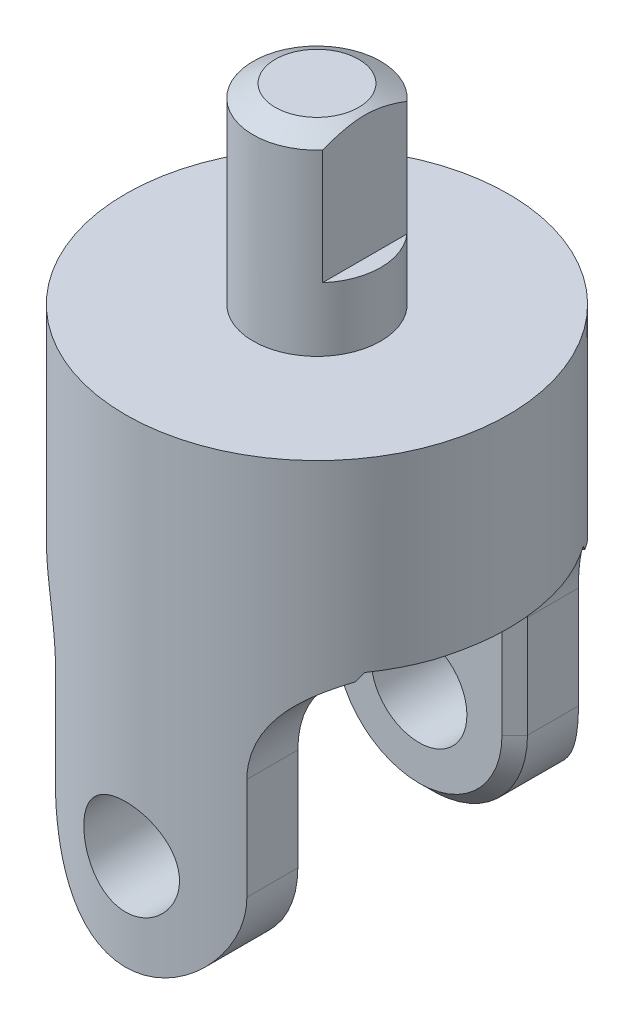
ISO-10303-21;
HEADER;
FILE_DESCRIPTION(('STEP AP214'),'2;1');
FILE_NAME('part.step','',(''),(''),'','','');
FILE_SCHEMA(('AUTOMOTIVE_DESIGN { 1 0 10303 214 1 1 1 1 }'));
ENDSEC;
DATA;
#1=APPLICATION_CONTEXT('core data for automotive mechanical design processes');
#2=APPLICATION_PROTOCOL_DEFINITION('international standard','automotive_design',2000,#1);
#3=PRODUCT_CONTEXT('',#1,'mechanical');
#4=PRODUCT('Part','Part','',(#3));
#5=PRODUCT_RELATED_PRODUCT_CATEGORY('part','',(#4));
#6=PRODUCT_DEFINITION_FORMATION('','',#4);
#7=PRODUCT_DEFINITION_CONTEXT('part definition',#1,'design');
#8=PRODUCT_DEFINITION('design','',#6,#7);
#9=PRODUCT_DEFINITION_SHAPE('','',#8);
#10=(LENGTH_UNIT() NAMED_UNIT(*) SI_UNIT(.MILLI.,.METRE.));
#11=(NAMED_UNIT(*) PLANE_ANGLE_UNIT() SI_UNIT($,.RADIAN.));
#12=(NAMED_UNIT(*) SI_UNIT($,.STERADIAN.) SOLID_ANGLE_UNIT());
#13=UNCERTAINTY_MEASURE_WITH_UNIT(LENGTH_MEASURE(1.E-05),#10,'distance_accuracy_value','');
#14=(GEOMETRIC_REPRESENTATION_CONTEXT(3) GLOBAL_UNCERTAINTY_ASSIGNED_CONTEXT((#13)) GLOBAL_UNIT_ASSIGNED_CONTEXT((#10,
#11,#12)) REPRESENTATION_CONTEXT('',''));
#15=CARTESIAN_POINT('',(0.,0.,0.));
#16=DIRECTION('',(0.,0.,1.));
#17=DIRECTION('',(1.,0.,0.));
#18=AXIS2_PLACEMENT_3D('',#15,#16,#17);
#19=CARTESIAN_POINT('',(0.,66.675,0.));
#20=DIRECTION('',(0.,-1.,0.));
#21=DIRECTION('',(0.,0.,-1.));
#22=AXIS2_PLACEMENT_3D('',#19,#20,#21);
#23=CYLINDRICAL_SURFACE('',#22,6.35);
#24=CARTESIAN_POINT('',(0.,47.625,0.));
#25=DIRECTION('',(0.,1.,0.));
#26=DIRECTION('',(0.,0.,1.));
#27=AXIS2_PLACEMENT_3D('',#24,#25,#26);
#28=CIRCLE('',#27,6.35);
#29=CARTESIAN_POINT('',(0.,47.625,6.35));
#30=VERTEX_POINT('',#29);
#31=EDGE_CURVE('E202',#30,#30,#28,.T.);
#32=ORIENTED_EDGE('',*,*,#31,.T.);
#33=EDGE_LOOP('',(#32));
#34=FACE_BOUND('',#33,.T.);
#35=DIRECTION('',(0.,1.,0.));
#36=VECTOR('',#35,1.);
#37=CARTESIAN_POINT('',(4.7625,53.975,4.20013020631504));
#38=LINE('',#37,#36);
#39=CARTESIAN_POINT('',(4.7625,53.975,4.20013020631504));
#40=VERTEX_POINT('',#39);
#41=CARTESIAN_POINT('',(4.7625,65.405,4.20013020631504));
#42=VERTEX_POINT('',#41);
#43=EDGE_CURVE('E189',#40,#42,#38,.T.);
#44=ORIENTED_EDGE('',*,*,#43,.T.);
#45=CARTESIAN_POINT('',(0.,65.405,0.));
#46=DIRECTION('',(0.,1.,0.));
#47=DIRECTION('',(0.,0.,1.));
#48=AXIS2_PLACEMENT_3D('',#45,#46,#47);
#49=CIRCLE('',#48,6.35);
#50=CARTESIAN_POINT('',(4.7625,65.405,-4.20013020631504));
#51=VERTEX_POINT('',#50);
#52=EDGE_CURVE('E200',#42,#51,#49,.F.);
#53=ORIENTED_EDGE('',*,*,#52,.T.);
#54=DIRECTION('',(0.,1.,0.));
#55=VECTOR('',#54,1.);
#56=CARTESIAN_POINT('',(4.7625,53.975,-4.20013020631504));
#57=LINE('',#56,#55);
#58=CARTESIAN_POINT('',(4.7625,53.975,-4.20013020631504));
#59=VERTEX_POINT('',#58);
#60=EDGE_CURVE('E186',#59,#51,#57,.T.);
#61=ORIENTED_EDGE('',*,*,#60,.F.);
#62=CARTESIAN_POINT('',(0.,53.975,0.));
#63=DIRECTION('',(0.,1.,0.));
#64=DIRECTION('',(0.,0.,1.));
#65=AXIS2_PLACEMENT_3D('',#62,#63,#64);
#66=CIRCLE('',#65,6.35);
#67=EDGE_CURVE('E192',#40,#59,#66,.T.);
#68=ORIENTED_EDGE('',*,*,#67,.F.);
#69=EDGE_LOOP('',(#44,#53,#61,#68));
#70=FACE_BOUND('',#69,.T.);
#71=ADVANCED_FACE('F28',(#34,#70),#23,.T.);
#72=CARTESIAN_POINT('',(0.,66.675,0.));
#73=DIRECTION('',(0.,-1.,0.));
#74=DIRECTION('',(0.,0.,-1.));
#75=AXIS2_PLACEMENT_3D('',#72,#73,#74);
#76=CONICAL_SURFACE('',#75,4.15029547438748,1.0471975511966);
#77=CARTESIAN_POINT('',(0.,66.675,0.));
#78=DIRECTION('',(0.,1.,0.));
#79=DIRECTION('',(0.,0.,1.));
#80=AXIS2_PLACEMENT_3D('',#77,#78,#79);
#81=CIRCLE('',#80,4.15029547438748);
#82=CARTESIAN_POINT('',(0.,66.675,4.15029547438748));
#83=VERTEX_POINT('',#82);
#84=EDGE_CURVE('E436',#83,#83,#81,.T.);
#85=ORIENTED_EDGE('',*,*,#84,.F.);
#86=EDGE_LOOP('',(#85));
#87=FACE_BOUND('',#86,.T.);
#88=ORIENTED_EDGE('',*,*,#52,.F.);
#89=CARTESIAN_POINT('',(4.7625,63.3576640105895,-8.67474438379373));
#90=CARTESIAN_POINT('',(4.7625,63.469711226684,-8.45330719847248));
#91=CARTESIAN_POINT('',(4.7625,63.5810014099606,-8.23148237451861));
#92=CARTESIAN_POINT('',(4.7625,63.8016576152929,-7.7868546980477));
#93=CARTESIAN_POINT('',(4.7625,63.9110234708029,-7.56405176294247));
#94=CARTESIAN_POINT('',(4.7625,64.1277386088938,-7.11660713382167));
#95=CARTESIAN_POINT('',(4.7625,64.2350805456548,-6.89196187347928));
#96=CARTESIAN_POINT('',(4.7625,64.4468042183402,-6.4412857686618));
#97=CARTESIAN_POINT('',(4.7625,64.551186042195,-6.21525496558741));
#98=CARTESIAN_POINT('',(4.7625,64.761300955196,-5.75026984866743));
#99=CARTESIAN_POINT('',(4.7625,64.8668450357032,-5.51122979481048));
#100=CARTESIAN_POINT('',(4.7625,65.0726380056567,-5.03084667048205));
#101=CARTESIAN_POINT('',(4.7625,65.1728864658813,-4.78950341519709));
#102=CARTESIAN_POINT('',(4.7625,65.3663272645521,-4.30430471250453));
#103=CARTESIAN_POINT('',(4.7625,65.4595275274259,-4.06045244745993));
#104=CARTESIAN_POINT('',(4.7625,65.6367537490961,-3.56945984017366));
#105=CARTESIAN_POINT('',(4.7625,65.7207816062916,-3.32232019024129));
#106=CARTESIAN_POINT('',(4.7625,65.8759823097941,-2.82653408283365));
#107=CARTESIAN_POINT('',(4.7625,65.9472687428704,-2.57792372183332));
#108=CARTESIAN_POINT('',(4.7625,66.0743145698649,-2.07671605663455));
#109=CARTESIAN_POINT('',(4.7625,66.1300751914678,-1.82411906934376));
#110=CARTESIAN_POINT('',(4.7625,66.2212225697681,-1.31963718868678));
#111=CARTESIAN_POINT('',(4.7625,66.2569437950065,-1.06781500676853));
#112=CARTESIAN_POINT('',(4.7625,66.2938959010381,-0.68850128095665));
#113=CARTESIAN_POINT('',(4.7625,66.3034417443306,-0.561789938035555));
#114=CARTESIAN_POINT('',(4.7625,66.3167609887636,-0.308068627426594));
#115=CARTESIAN_POINT('',(4.7625,66.3205349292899,-0.181058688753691));
#116=CARTESIAN_POINT('',(4.7625,66.3223134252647,0.0905838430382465));
#117=CARTESIAN_POINT('',(4.7625,66.3194472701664,0.235222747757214));
#118=CARTESIAN_POINT('',(4.7625,66.3061907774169,0.524155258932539));
#119=CARTESIAN_POINT('',(4.7625,66.2958001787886,0.66844885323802));
#120=CARTESIAN_POINT('',(4.7625,66.2678495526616,0.956362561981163));
#121=CARTESIAN_POINT('',(4.7625,66.2502880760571,1.09998253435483));
#122=CARTESIAN_POINT('',(4.7625,66.2085467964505,1.38625029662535));
#123=CARTESIAN_POINT('',(4.7625,66.18436689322,1.52889807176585));
#124=CARTESIAN_POINT('',(4.7625,66.1293852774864,1.81654493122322));
#125=CARTESIAN_POINT('',(4.7625,66.0984351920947,1.96151543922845));
#126=CARTESIAN_POINT('',(4.7625,66.0310411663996,2.25016667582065));
#127=CARTESIAN_POINT('',(4.7625,65.9945971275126,2.39384738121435));
#128=CARTESIAN_POINT('',(4.7625,65.9169451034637,2.67992954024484));
#129=CARTESIAN_POINT('',(4.7625,65.8757364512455,2.82233081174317));
#130=CARTESIAN_POINT('',(4.7625,65.7892365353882,3.10586895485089));
#131=CARTESIAN_POINT('',(4.7625,65.7439455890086,3.24700592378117));
#132=CARTESIAN_POINT('',(4.7625,65.6406667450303,3.55563142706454));
#133=CARTESIAN_POINT('',(4.7625,65.5819291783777,3.72286847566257));
#134=CARTESIAN_POINT('',(4.7625,65.4603269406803,4.05584009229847));
#135=CARTESIAN_POINT('',(4.7625,65.3974619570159,4.22157454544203));
#136=CARTESIAN_POINT('',(4.7625,65.2037410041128,4.71688299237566));
#137=CARTESIAN_POINT('',(4.7625,65.0677927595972,5.04446416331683));
#138=CARTESIAN_POINT('',(4.7625,64.7863691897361,5.69594921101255));
#139=CARTESIAN_POINT('',(4.7625,64.6408818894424,6.01984784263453));
#140=CARTESIAN_POINT('',(4.7625,64.3432582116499,6.66450132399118));
#141=CARTESIAN_POINT('',(4.7625,64.1911228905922,6.98525666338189));
#142=CARTESIAN_POINT('',(4.7625,63.8813253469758,7.62580230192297));
#143=CARTESIAN_POINT('',(4.7625,63.7236419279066,7.9455823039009));
#144=CARTESIAN_POINT('',(4.7625,63.4046196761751,8.58332268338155));
#145=CARTESIAN_POINT('',(4.7625,63.2432807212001,8.90128299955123));
#146=CARTESIAN_POINT('',(4.7625,62.9179416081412,9.53554216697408));
#147=CARTESIAN_POINT('',(4.7625,62.7539434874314,9.85184206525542));
#148=CARTESIAN_POINT('',(4.7625,62.4237848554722,10.4833121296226));
#149=CARTESIAN_POINT('',(4.7625,62.257624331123,10.7984822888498));
#150=CARTESIAN_POINT('',(4.7625,61.8068664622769,11.6479048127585));
#151=CARTESIAN_POINT('',(4.7625,61.5206664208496,12.181306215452));
#152=CARTESIAN_POINT('',(4.7625,60.9448108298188,13.2463803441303));
#153=CARTESIAN_POINT('',(4.7625,60.6551545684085,13.7780526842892));
#154=CARTESIAN_POINT('',(4.7625,60.0757028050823,14.8358326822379));
#155=CARTESIAN_POINT('',(4.7625,59.7859267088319,15.3619509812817));
#156=CARTESIAN_POINT('',(4.7625,59.2046035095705,16.4130517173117));
#157=CARTESIAN_POINT('',(4.7625,58.9130568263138,16.9380343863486));
#158=CARTESIAN_POINT('',(4.7625,58.620879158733,17.4626628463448));
#159=B_SPLINE_CURVE_WITH_KNOTS('',3,(#89,#90,#91,#92,#93,#94,#95,#96,#97,#98,#99,#100,#101,#102,
#103,#104,#105,#106,#107,#108,#109,#110,#111,#112,#113,#114,#115,#116,#117,#118,#119,#120,#121,
#122,#123,#124,#125,#126,#127,#128,#129,#130,#131,#132,#133,#134,#135,#136,#137,#138,#139,#140,
#141,#142,#143,#144,#145,#146,#147,#148,#149,#150,#151,#152,#153,#154,#155,#156,#157,#158),
.UNSPECIFIED.,.F.,.F.,(4,2,2,2,2,2,2,2,2,2,2,2,2,2,2,2,2,2,2,2,2,2,2,2,2,2,2,2,2,2,2,2,2,2,4),
(0.,0.744518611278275,1.48910134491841,2.23600427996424,2.98288500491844,3.7667475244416,
4.55067348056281,5.33370452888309,6.11657320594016,6.89207080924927,7.66750707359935,
8.42958338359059,8.81068147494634,9.19174395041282,9.6255420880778,10.0593552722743,
10.4932561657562,10.927163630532,11.3717539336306,11.8163522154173,12.2610128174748,
12.7056388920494,13.2373268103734,13.7690550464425,14.8328219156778,15.8979507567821,
16.9629109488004,18.0325121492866,19.102149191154,20.1710021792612,21.2398616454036,
23.0558392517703,24.8721975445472,26.6741189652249,28.4756286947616),.UNSPECIFIED.);
#160=EDGE_CURVE('E311',#42,#51,#159,.F.);
#161=ORIENTED_EDGE('',*,*,#160,.T.);
#162=EDGE_LOOP('',(#88,#161));
#163=FACE_BOUND('',#162,.T.);
#164=ADVANCED_FACE('F308',(#87,#163),#76,.T.);
#165=CARTESIAN_POINT('',(0.,47.625,0.));
#166=DIRECTION('',(0.,1.,0.));
#167=DIRECTION('',(0.,0.,1.));
#168=AXIS2_PLACEMENT_3D('',#165,#166,#167);
#169=PLANE('',#168);
#170=CARTESIAN_POINT('',(0.,47.625,0.));
#171=DIRECTION('',(0.,1.,0.));
#172=DIRECTION('',(0.,0.,1.));
#173=AXIS2_PLACEMENT_3D('',#170,#171,#172);
#174=CIRCLE('',#173,19.05);
#175=CARTESIAN_POINT('',(0.,47.625,19.05));
#176=VERTEX_POINT('',#175);
#177=EDGE_CURVE('E705',#176,#176,#174,.T.);
#178=ORIENTED_EDGE('',*,*,#177,.T.);
#179=EDGE_LOOP('',(#178));
#180=FACE_BOUND('',#179,.T.);
#181=ORIENTED_EDGE('',*,*,#31,.F.);
#182=EDGE_LOOP('',(#181));
#183=FACE_BOUND('',#182,.T.);
#184=ADVANCED_FACE('F415',(#180,#183),#169,.T.);
#185=CARTESIAN_POINT('',(0.,47.625,0.));
#186=DIRECTION('',(0.,-1.,0.));
#187=DIRECTION('',(0.,0.,-1.));
#188=AXIS2_PLACEMENT_3D('',#185,#186,#187);
#189=CYLINDRICAL_SURFACE('',#188,19.05);
#190=CARTESIAN_POINT('',(0.,14.2875,-19.05));
#191=CARTESIAN_POINT('',(-0.263131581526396,14.2874926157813,-19.0499955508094));
#192=CARTESIAN_POINT('',(-0.526345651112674,14.2656193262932,-19.0444938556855));
#193=CARTESIAN_POINT('',(-1.04523007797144,14.1788351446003,-19.0230796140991));
#194=CARTESIAN_POINT('',(-1.3008960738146,14.1138998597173,-19.0071611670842));
#195=CARTESIAN_POINT('',(-1.79711626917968,13.9432053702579,-18.966676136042));
#196=CARTESIAN_POINT('',(-2.03768821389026,13.837495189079,-18.9421199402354));
#197=CARTESIAN_POINT('',(-2.49768401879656,13.5884240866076,-18.886974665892));
#198=CARTESIAN_POINT('',(-2.71710716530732,13.4450618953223,-18.8563853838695));
#199=CARTESIAN_POINT('',(-3.1330961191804,13.121637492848,-18.7917903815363));
#200=CARTESIAN_POINT('',(-3.32916431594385,12.940945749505,-18.757731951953));
#201=CARTESIAN_POINT('',(-3.68855284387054,12.5493392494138,-18.6903874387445));
#202=CARTESIAN_POINT('',(-3.85186947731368,12.3384210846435,-18.6571014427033));
#203=CARTESIAN_POINT('',(-4.14345927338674,11.8884851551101,-18.5945391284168));
#204=CARTESIAN_POINT('',(-4.27117578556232,11.6490964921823,-18.5653297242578));
#205=CARTESIAN_POINT('',(-4.48436018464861,11.1513987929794,-18.514996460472));
#206=CARTESIAN_POINT('',(-4.56983482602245,10.8930927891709,-18.4938713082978));
#207=CARTESIAN_POINT('',(-4.69441160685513,10.3703643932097,-18.4626401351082));
#208=CARTESIAN_POINT('',(-4.73440845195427,10.1061682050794,-18.4523218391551));
#209=CARTESIAN_POINT('',(-4.76968113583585,9.57462979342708,-18.443237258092));
#210=CARTESIAN_POINT('',(-4.7649642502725,9.30728808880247,-18.4444690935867));
#211=CARTESIAN_POINT('',(-4.71165721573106,8.78390481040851,-18.4581547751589));
#212=CARTESIAN_POINT('',(-4.66413323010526,8.52774640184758,-18.4703359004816));
#213=CARTESIAN_POINT('',(-4.528261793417,8.02715866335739,-18.5041130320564));
#214=CARTESIAN_POINT('',(-4.43991143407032,7.78273017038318,-18.5257097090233));
#215=CARTESIAN_POINT('',(-4.22398659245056,7.30968179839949,-18.5761348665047));
#216=CARTESIAN_POINT('',(-4.09602516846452,7.08124640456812,-18.6050341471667));
#217=CARTESIAN_POINT('',(-3.80478117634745,6.6487080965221,-18.6667683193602));
#218=CARTESIAN_POINT('',(-3.64149242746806,6.44460944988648,-18.6996038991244));
#219=CARTESIAN_POINT('',(-3.27870637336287,6.06042852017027,-18.7666592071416));
#220=CARTESIAN_POINT('',(-3.07830936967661,5.88119699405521,-18.8008917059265));
#221=CARTESIAN_POINT('',(-2.64989283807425,5.55872255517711,-18.8660394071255));
#222=CARTESIAN_POINT('',(-2.42187246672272,5.41548074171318,-18.8969545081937));
#223=CARTESIAN_POINT('',(-1.94346794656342,5.16873938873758,-18.9521379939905));
#224=CARTESIAN_POINT('',(-1.69300967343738,5.06537804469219,-18.9763831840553));
#225=CARTESIAN_POINT('',(-1.17753132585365,4.90246255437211,-19.0153263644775));
#226=CARTESIAN_POINT('',(-0.912514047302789,4.84290002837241,-19.0300261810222));
#227=CARTESIAN_POINT('',(-0.382714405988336,4.77057222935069,-19.0479521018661));
#228=CARTESIAN_POINT('',(-0.118099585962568,4.75664839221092,-19.0514621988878));
#229=CARTESIAN_POINT('',(0.409679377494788,4.77281558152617,-19.0474220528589));
#230=CARTESIAN_POINT('',(0.672843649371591,4.80290264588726,-19.0398728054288));
#231=CARTESIAN_POINT('',(1.18622530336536,4.90528263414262,-19.0147442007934));
#232=CARTESIAN_POINT('',(1.43657675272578,4.97694351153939,-18.9973151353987));
#233=CARTESIAN_POINT('',(1.92169190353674,5.15971499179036,-18.9543914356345));
#234=CARTESIAN_POINT('',(2.15645402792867,5.27082957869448,-18.928895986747));
#235=CARTESIAN_POINT('',(2.60833595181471,5.5315997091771,-18.8719875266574));
#236=CARTESIAN_POINT('',(2.82506877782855,5.6819041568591,-18.8404775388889));
#237=CARTESIAN_POINT('',(3.23064699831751,6.015957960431,-18.7751881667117));
#238=CARTESIAN_POINT('',(3.41948756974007,6.19971308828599,-18.7414083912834));
#239=CARTESIAN_POINT('',(3.76869505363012,6.60083122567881,-18.6743643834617));
#240=CARTESIAN_POINT('',(3.92824927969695,6.81890845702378,-18.6411331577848));
#241=CARTESIAN_POINT('',(4.20849665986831,7.27942611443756,-18.5798738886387));
#242=CARTESIAN_POINT('',(4.32919153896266,7.5218654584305,-18.5518456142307));
#243=CARTESIAN_POINT('',(4.5273957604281,8.02292566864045,-18.5044745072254));
#244=CARTESIAN_POINT('',(4.60516095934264,8.28144021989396,-18.4850803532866));
#245=CARTESIAN_POINT('',(4.71597247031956,8.80843310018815,-18.457124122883));
#246=CARTESIAN_POINT('',(4.7490285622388,9.0769092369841,-18.4485596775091));
#247=CARTESIAN_POINT('',(4.76897252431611,9.6079342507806,-18.4434131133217));
#248=CARTESIAN_POINT('',(4.75715932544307,9.87043185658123,-18.4464938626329));
#249=CARTESIAN_POINT('',(4.69067285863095,10.3895648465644,-18.4635111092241));
#250=CARTESIAN_POINT('',(4.63600045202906,10.6462003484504,-18.4774473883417));
#251=CARTESIAN_POINT('',(4.48605693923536,11.1449118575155,-18.5144175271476));
#252=CARTESIAN_POINT('',(4.39102945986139,11.3870654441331,-18.5373967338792));
#253=CARTESIAN_POINT('',(4.1632661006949,11.8521650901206,-18.5898712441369));
#254=CARTESIAN_POINT('',(4.03052499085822,12.0751084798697,-18.6193674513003));
#255=CARTESIAN_POINT('',(3.72703010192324,12.5017359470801,-18.6825138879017));
#256=CARTESIAN_POINT('',(3.5553750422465,12.7047659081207,-18.7162524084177));
#257=CARTESIAN_POINT('',(3.18068125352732,13.0795618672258,-18.7835548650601));
#258=CARTESIAN_POINT('',(2.97763508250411,13.2513204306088,-18.8171187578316));
#259=CARTESIAN_POINT('',(2.54148458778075,13.5617309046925,-18.8810155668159));
#260=CARTESIAN_POINT('',(2.30790249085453,13.6997268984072,-18.911278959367));
#261=CARTESIAN_POINT('',(1.82011973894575,13.9342731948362,-18.9644313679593));
#262=CARTESIAN_POINT('',(1.56593401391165,14.0308531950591,-18.9873256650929));
#263=CARTESIAN_POINT('',(1.09350255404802,14.1654905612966,-19.0197758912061));
#264=CARTESIAN_POINT('',(0.87750704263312,14.2111451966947,-19.031032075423));
#265=CARTESIAN_POINT('',(0.441026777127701,14.2721518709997,-19.0461457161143));
#266=CARTESIAN_POINT('',(0.220542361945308,14.2875061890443,-19.0500037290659));
#267=CARTESIAN_POINT('',(0.,14.2875,-19.05));
#268=B_SPLINE_CURVE_WITH_KNOTS('',3,(#190,#191,#192,#193,#194,#195,#196,#197,#198,#199,#200,
#201,#202,#203,#204,#205,#206,#207,#208,#209,#210,#211,#212,#213,#214,#215,#216,#217,#218,#219,
#220,#221,#222,#223,#224,#225,#226,#227,#228,#229,#230,#231,#232,#233,#234,#235,#236,#237,#238,
#239,#240,#241,#242,#243,#244,#245,#246,#247,#248,#249,#250,#251,#252,#253,#254,#255,#256,#257,
#258,#259,#260,#261,#262,#263,#264,#265,#266,#267),.UNSPECIFIED.,.T.,.F.,(4,2,2,2,2,2,2,2,2,2,2,
2,2,2,2,2,2,2,2,2,2,2,2,2,2,2,2,2,2,2,2,2,2,2,2,2,2,2,4),(0.,0.78858653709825,1.57762015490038,
2.36570806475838,3.15382256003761,3.95650832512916,4.75928466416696,5.57398705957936,
6.38855914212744,7.18681236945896,7.98493571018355,8.76371428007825,9.54254833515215,
10.3292442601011,11.1160779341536,11.9253476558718,12.7346420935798,13.5467162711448,
14.3586350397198,15.1497763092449,15.940846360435,16.7201937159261,17.4996197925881,
18.2928764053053,19.08627002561,19.8991381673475,20.7119702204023,21.5199040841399,
22.3276611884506,23.1122150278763,23.8967531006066,24.6766207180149,25.4565965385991,
26.2569190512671,27.0574315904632,27.8724418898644,28.6868668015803,29.3478662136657,
30.008815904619),.UNSPECIFIED.);
#269=CARTESIAN_POINT('',(0.,14.2875,-19.05));
#270=VERTEX_POINT('',#269);
#271=EDGE_CURVE('E217',#270,#270,#268,.T.);
#272=ORIENTED_EDGE('',*,*,#271,.T.);
#273=EDGE_LOOP('',(#272));
#274=FACE_BOUND('',#273,.T.);
#275=CARTESIAN_POINT('',(4.7625,9.525,18.4450831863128));
#276=CARTESIAN_POINT('',(4.7624925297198,9.26201331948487,18.4450882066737));
#277=CARTESIAN_POINT('',(4.74064249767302,8.99894396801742,18.4507690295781));
#278=CARTESIAN_POINT('',(4.65395905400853,8.48035976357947,18.4728204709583));
#279=CARTESIAN_POINT('',(4.58910062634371,8.22484939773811,18.4891973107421));
#280=CARTESIAN_POINT('',(4.41863073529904,7.72895925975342,18.5306727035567));
#281=CARTESIAN_POINT('',(4.31307188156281,7.48856041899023,18.5557599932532));
#282=CARTESIAN_POINT('',(4.06435777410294,7.02885782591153,18.6118155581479));
#283=CARTESIAN_POINT('',(3.92120092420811,6.80955496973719,18.6427840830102));
#284=CARTESIAN_POINT('',(3.59798955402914,6.39344356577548,18.7078756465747));
#285=CARTESIAN_POINT('',(3.41725927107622,6.19716769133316,18.7420490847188));
#286=CARTESIAN_POINT('',(3.02548683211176,5.83737454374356,18.8092627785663));
#287=CARTESIAN_POINT('',(2.81444184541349,5.67386033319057,18.8423029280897));
#288=CARTESIAN_POINT('',(2.36438160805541,5.38205273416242,18.9040849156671));
#289=CARTESIAN_POINT('',(2.12501716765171,5.25428263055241,18.9327603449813));
#290=CARTESIAN_POINT('',(1.62737136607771,5.04099262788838,18.98200696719));
#291=CARTESIAN_POINT('',(1.36909280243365,4.95546649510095,19.0025793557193));
#292=CARTESIAN_POINT('',(0.846503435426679,4.8307983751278,19.0329456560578));
#293=CARTESIAN_POINT('',(0.582420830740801,4.79075182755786,19.0429494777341));
#294=CARTESIAN_POINT('',(0.0511089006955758,4.75534028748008,19.0517829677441));
#295=CARTESIAN_POINT('',(-0.216119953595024,4.75996868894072,19.0506142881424));
#296=CARTESIAN_POINT('',(-0.739865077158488,4.81312508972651,19.0373907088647));
#297=CARTESIAN_POINT('',(-0.996487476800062,4.86067669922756,19.0255779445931));
#298=CARTESIAN_POINT('',(-1.4979884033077,4.99676026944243,18.992675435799));
#299=CARTESIAN_POINT('',(-1.74286630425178,5.08529441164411,18.9715851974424));
#300=CARTESIAN_POINT('',(-2.21649942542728,5.30161989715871,18.9221270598));
#301=CARTESIAN_POINT('',(-2.44508897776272,5.42975872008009,18.8936951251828));
#302=CARTESIAN_POINT('',(-2.87786265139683,5.72139256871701,18.8326376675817));
#303=CARTESIAN_POINT('',(-3.08204251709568,5.88489374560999,18.8000114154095));
#304=CARTESIAN_POINT('',(-3.46602384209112,6.24784515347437,18.733078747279));
#305=CARTESIAN_POINT('',(-3.6450159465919,6.44814856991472,18.6987507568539));
#306=CARTESIAN_POINT('',(-3.96704999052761,6.87628794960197,18.6330915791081));
#307=CARTESIAN_POINT('',(-4.11009024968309,7.10412519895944,18.6017605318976));
#308=CARTESIAN_POINT('',(-4.35667846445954,7.58245251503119,18.5455654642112));
#309=CARTESIAN_POINT('',(-4.46003156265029,7.8330470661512,18.5207335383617));
#310=CARTESIAN_POINT('',(-4.6228902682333,8.34882531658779,18.4807600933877));
#311=CARTESIAN_POINT('',(-4.68240525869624,8.61400588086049,18.4656165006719));
#312=CARTESIAN_POINT('',(-4.75455546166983,9.14392285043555,18.4471695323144));
#313=CARTESIAN_POINT('',(-4.76838735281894,9.40848599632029,18.4435639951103));
#314=CARTESIAN_POINT('',(-4.75205486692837,9.93614078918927,18.4477788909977));
#315=CARTESIAN_POINT('',(-4.72189453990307,10.1992325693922,18.4555982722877));
#316=CARTESIAN_POINT('',(-4.61948300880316,10.7120326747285,18.4814924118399));
#317=CARTESIAN_POINT('',(-4.54792855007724,10.9618895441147,18.4993972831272));
#318=CARTESIAN_POINT('',(-4.36553244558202,11.4460619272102,18.5432836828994));
#319=CARTESIAN_POINT('',(-4.25468614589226,11.6803755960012,18.5692661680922));
#320=CARTESIAN_POINT('',(-3.99434812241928,12.1318806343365,18.6270164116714));
#321=CARTESIAN_POINT('',(-3.84414094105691,12.3486459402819,18.6588876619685));
#322=CARTESIAN_POINT('',(-3.51024964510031,12.7543338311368,18.7245704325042));
#323=CARTESIAN_POINT('',(-3.32656002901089,12.9432518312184,18.7583822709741));
#324=CARTESIAN_POINT('',(-2.92542620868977,13.2927300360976,18.8251605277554));
#325=CARTESIAN_POINT('',(-2.70725242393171,13.4524624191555,18.8580846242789));
#326=CARTESIAN_POINT('',(-2.24648402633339,13.7330228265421,18.9185019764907));
#327=CARTESIAN_POINT('',(-2.00389068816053,13.8538528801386,18.9459955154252));
#328=CARTESIAN_POINT('',(-1.50284593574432,14.0521296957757,18.9922807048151));
#329=CARTESIAN_POINT('',(-1.24452402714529,14.1298884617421,19.0111347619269));
#330=CARTESIAN_POINT('',(-0.717945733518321,14.240751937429,19.0382898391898));
#331=CARTESIAN_POINT('',(-0.449691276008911,14.2738652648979,19.0465928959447));
#332=CARTESIAN_POINT('',(0.0813602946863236,14.2940131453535,19.0516273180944));
#333=CARTESIAN_POINT('',(0.344108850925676,14.2822693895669,19.0486654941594));
#334=CARTESIAN_POINT('',(0.863762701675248,14.2158347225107,19.0321833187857));
#335=CARTESIAN_POINT('',(1.12066816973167,14.1611450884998,19.0186632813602));
#336=CARTESIAN_POINT('',(1.62006455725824,14.0110263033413,18.9826312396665));
#337=CARTESIAN_POINT('',(1.86262563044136,13.9158180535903,18.9601680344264));
#338=CARTESIAN_POINT('',(2.32846746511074,13.6875651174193,18.908615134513));
#339=CARTESIAN_POINT('',(2.55174579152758,13.5545156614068,18.8795246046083));
#340=CARTESIAN_POINT('',(2.97847668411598,13.2506311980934,18.8169827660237));
#341=CARTESIAN_POINT('',(3.18132613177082,13.0789673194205,18.7834436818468));
#342=CARTESIAN_POINT('',(3.55575403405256,12.7043361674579,18.7161796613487));
#343=CARTESIAN_POINT('',(3.72732454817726,12.5013609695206,18.6824546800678));
#344=CARTESIAN_POINT('',(4.0374666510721,12.0653107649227,18.6179210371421));
#345=CARTESIAN_POINT('',(4.1753628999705,11.831744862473,18.5871785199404));
#346=CARTESIAN_POINT('',(4.4097268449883,11.3440107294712,18.5329808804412));
#347=CARTESIAN_POINT('',(4.50622468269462,11.0898576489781,18.5095204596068));
#348=CARTESIAN_POINT('',(4.6406872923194,10.6176269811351,18.4762096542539));
#349=CARTESIAN_POINT('',(4.68626747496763,10.401808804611,18.4646250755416));
#350=CARTESIAN_POINT('',(4.74717566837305,9.96567951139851,18.4490600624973));
#351=CARTESIAN_POINT('',(4.76250625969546,9.74536877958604,18.4450789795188));
#352=CARTESIAN_POINT('',(4.7625,9.525,18.4450831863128));
#353=B_SPLINE_CURVE_WITH_KNOTS('',3,(#275,#276,#277,#278,#279,#280,#281,#282,#283,#284,#285,
#286,#287,#288,#289,#290,#291,#292,#293,#294,#295,#296,#297,#298,#299,#300,#301,#302,#303,#304,
#305,#306,#307,#308,#309,#310,#311,#312,#313,#314,#315,#316,#317,#318,#319,#320,#321,#322,#323,
#324,#325,#326,#327,#328,#329,#330,#331,#332,#333,#334,#335,#336,#337,#338,#339,#340,#341,#342,
#343,#344,#345,#346,#347,#348,#349,#350,#351,#352),.UNSPECIFIED.,.T.,.F.,(4,2,2,2,2,2,2,2,2,2,2,
2,2,2,2,2,2,2,2,2,2,2,2,2,2,2,2,2,2,2,2,2,2,2,2,2,2,2,4),(0.,0.788150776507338,1.57676038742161,
2.36435403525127,3.15198112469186,3.95523632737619,4.75856658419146,5.57310600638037,
6.3875251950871,7.18544570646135,7.98324823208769,8.76334790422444,9.54348910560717,
10.3306792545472,11.1180064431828,11.9266423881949,12.7353161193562,13.5479110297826,
14.3603319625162,15.1512950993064,15.9421854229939,16.7201355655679,17.4981778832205,
18.2914832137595,19.0849190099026,19.8982075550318,20.7114536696,21.5187289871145,
22.3258484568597,23.1111446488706,23.896417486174,24.677462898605,25.4586067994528,
26.258464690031,27.0585253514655,27.8735118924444,28.6879040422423,29.3483886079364,
30.0088168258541),.UNSPECIFIED.);
#354=CARTESIAN_POINT('',(4.7625,9.525,18.4450831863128));
#355=VERTEX_POINT('',#354);
#356=EDGE_CURVE('E211',#355,#355,#353,.T.);
#357=ORIENTED_EDGE('',*,*,#356,.T.);
#358=EDGE_LOOP('',(#357));
#359=FACE_BOUND('',#358,.T.);
#360=ORIENTED_EDGE('',*,*,#177,.F.);
#361=EDGE_LOOP('',(#360));
#362=FACE_BOUND('',#361,.T.);
#363=CARTESIAN_POINT('',(0.,29.1452388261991,0.));
#364=DIRECTION('',(0.,1.,0.));
#365=DIRECTION('',(0.,0.,1.));
#366=AXIS2_PLACEMENT_3D('',#363,#364,#365);
#367=CIRCLE('',#366,19.05);
#368=CARTESIAN_POINT('',(17.9411689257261,29.1452388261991,-6.40444826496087));
#369=VERTEX_POINT('',#368);
#370=CARTESIAN_POINT('',(15.6272218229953,29.1452388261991,-10.8946059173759));
#371=VERTEX_POINT('',#370);
#372=EDGE_CURVE('E360',#369,#371,#367,.T.);
#373=ORIENTED_EDGE('',*,*,#372,.T.);
#374=CARTESIAN_POINT('',(15.6272218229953,29.1452388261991,-10.8946059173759));
#375=CARTESIAN_POINT('',(15.5953162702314,29.085026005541,-10.9403714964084));
#376=CARTESIAN_POINT('',(15.5633026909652,29.0246618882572,-10.9858629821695));
#377=CARTESIAN_POINT('',(15.4990870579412,28.9036154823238,-11.0762752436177));
#378=CARTESIAN_POINT('',(15.4668850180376,28.8429332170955,-11.1211960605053));
#379=CARTESIAN_POINT('',(15.4023152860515,28.7212259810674,-11.2104512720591));
#380=CARTESIAN_POINT('',(15.3699475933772,28.6602010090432,-11.2547856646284));
#381=CARTESIAN_POINT('',(15.3050717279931,28.537783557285,-11.3428511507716));
#382=CARTESIAN_POINT('',(15.2725635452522,28.476391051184,-11.3865822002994));
#383=CARTESIAN_POINT('',(15.24,28.4148066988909,-11.43));
#384=B_SPLINE_CURVE_WITH_KNOTS('',3,(#374,#375,#376,#377,#378,#379,#380,#381,#382,#383),
.UNSPECIFIED.,.F.,.F.,(4,2,2,2,4),(0.,0.246256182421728,0.492494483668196,0.738733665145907,
0.984990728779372),.UNSPECIFIED.);
#385=CARTESIAN_POINT('',(15.24,28.4148066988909,-11.43));
#386=VERTEX_POINT('',#385);
#387=EDGE_CURVE('E288',#371,#386,#384,.T.);
#388=ORIENTED_EDGE('',*,*,#387,.T.);
#389=CARTESIAN_POINT('',(9.525,19.685,-16.4977839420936));
#390=CARTESIAN_POINT('',(9.52496088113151,19.918350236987,-16.4977688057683));
#391=CARTESIAN_POINT('',(9.53357353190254,20.1516967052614,-16.4928328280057));
#392=CARTESIAN_POINT('',(9.56782146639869,20.6166980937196,-16.4730087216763));
#393=CARTESIAN_POINT('',(9.59345572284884,20.8483531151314,-16.4581211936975));
#394=CARTESIAN_POINT('',(9.66141942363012,21.3080009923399,-16.4183108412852));
#395=CARTESIAN_POINT('',(9.70372594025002,21.5359984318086,-16.3934017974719));
#396=CARTESIAN_POINT('',(9.80447669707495,21.9870210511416,-16.3333461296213));
#397=CARTESIAN_POINT('',(9.86292069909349,22.2100463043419,-16.2981996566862));
#398=CARTESIAN_POINT('',(9.99521577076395,22.6496636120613,-16.217402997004));
#399=CARTESIAN_POINT('',(10.0690752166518,22.8662520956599,-16.1717470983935));
#400=CARTESIAN_POINT('',(10.2311827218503,23.2913603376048,-16.0696785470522));
#401=CARTESIAN_POINT('',(10.3194309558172,23.4998799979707,-16.0132657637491));
#402=CARTESIAN_POINT('',(10.5090589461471,23.9073731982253,-15.8894615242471));
#403=CARTESIAN_POINT('',(10.6104339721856,24.1063501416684,-15.8220740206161));
#404=CARTESIAN_POINT('',(10.8249101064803,24.4935871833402,-15.676116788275));
#405=CARTESIAN_POINT('',(10.9380111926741,24.6818473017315,-15.597547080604));
#406=CARTESIAN_POINT('',(11.1750060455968,25.0476354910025,-15.4286429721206));
#407=CARTESIAN_POINT('',(11.2989577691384,25.2250961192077,-15.3382439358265));
#408=CARTESIAN_POINT('',(11.5553164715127,25.5672655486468,-15.1460495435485));
#409=CARTESIAN_POINT('',(11.6877234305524,25.7319743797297,-15.0442542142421));
#410=CARTESIAN_POINT('',(11.9591574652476,26.0480960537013,-14.8293967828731));
#411=CARTESIAN_POINT('',(12.0981857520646,26.1995064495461,-14.7163326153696));
#412=CARTESIAN_POINT('',(12.3809708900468,26.4887188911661,-14.4792302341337));
#413=CARTESIAN_POINT('',(12.5247282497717,26.6265194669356,-14.3551908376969));
#414=CARTESIAN_POINT('',(12.8240785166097,26.8965620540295,-14.0885806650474));
#415=CARTESIAN_POINT('',(12.9798547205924,27.0279377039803,-13.9453388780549));
#416=CARTESIAN_POINT('',(13.292575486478,27.2756182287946,-13.6475843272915));
#417=CARTESIAN_POINT('',(13.4495200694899,27.3919228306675,-13.4930713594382));
#418=CARTESIAN_POINT('',(13.7627279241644,27.6100750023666,-13.1734537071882));
#419=CARTESIAN_POINT('',(13.91899104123,27.7119194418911,-13.0083467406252));
#420=CARTESIAN_POINT('',(14.2291584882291,27.9019462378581,-12.6683290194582));
#421=CARTESIAN_POINT('',(14.3830623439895,27.9901258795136,-12.4934163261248));
#422=CARTESIAN_POINT('',(14.7634251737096,28.1948863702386,-12.0444336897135));
#423=CARTESIAN_POINT('',(14.9875078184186,28.3034922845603,-11.7646791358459));
#424=CARTESIAN_POINT('',(15.4232003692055,28.4957157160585,-11.1874194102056));
#425=CARTESIAN_POINT('',(15.6348051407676,28.5793230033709,-10.8899070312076));
#426=CARTESIAN_POINT('',(16.0431146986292,28.7255421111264,-10.2789237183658));
#427=CARTESIAN_POINT('',(16.2397846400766,28.7881059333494,-9.96541815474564));
#428=CARTESIAN_POINT('',(16.615638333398,28.8957388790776,-9.32528378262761));
#429=CARTESIAN_POINT('',(16.7948218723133,28.9408077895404,-8.99865481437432));
#430=CARTESIAN_POINT('',(17.1918461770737,29.029905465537,-8.22145899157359));
#431=CARTESIAN_POINT('',(17.4021973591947,29.0684013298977,-7.76641658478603));
#432=CARTESIAN_POINT('',(17.786699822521,29.1278564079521,-6.84014068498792));
#433=CARTESIAN_POINT('',(17.9608394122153,29.1488099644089,-6.36890201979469));
#434=CARTESIAN_POINT('',(18.2714417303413,29.1794105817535,-5.41378881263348));
#435=CARTESIAN_POINT('',(18.4079009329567,29.1890565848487,-4.9299130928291));
#436=CARTESIAN_POINT('',(18.6421466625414,29.2019870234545,-3.95287775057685));
#437=CARTESIAN_POINT('',(18.7399368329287,29.2052720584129,-3.45971900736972));
#438=CARTESIAN_POINT('',(18.897358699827,29.2091078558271,-2.46008138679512));
#439=CARTESIAN_POINT('',(18.9564226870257,29.2096187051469,-1.95351291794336));
#440=CARTESIAN_POINT('',(19.033752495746,29.2100647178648,-0.937263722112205));
#441=CARTESIAN_POINT('',(19.0520174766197,29.209999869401,-0.427582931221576));
#442=CARTESIAN_POINT('',(19.0476285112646,29.2100001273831,0.591825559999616));
#443=CARTESIAN_POINT('',(19.0249568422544,29.2100652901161,1.10155318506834));
#444=CARTESIAN_POINT('',(18.9388075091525,29.2094475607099,2.11754548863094));
#445=CARTESIAN_POINT('',(18.8753295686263,29.2087646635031,2.62381014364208));
#446=CARTESIAN_POINT('',(18.7036160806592,29.2041086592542,3.65580332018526));
#447=CARTESIAN_POINT('',(18.5932233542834,29.1999661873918,4.18117378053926));
#448=CARTESIAN_POINT('',(18.3285057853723,29.1835599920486,5.22073652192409));
#449=CARTESIAN_POINT('',(18.1741722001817,29.1712946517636,5.73492655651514));
#450=CARTESIAN_POINT('',(17.8230306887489,29.1322930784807,6.74751648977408));
#451=CARTESIAN_POINT('',(17.6262637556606,29.1055707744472,7.24593109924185));
#452=CARTESIAN_POINT('',(17.1921907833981,29.0296619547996,8.22291578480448));
#453=CARTESIAN_POINT('',(16.9549063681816,28.9804873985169,8.70149627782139));
#454=CARTESIAN_POINT('',(16.5317482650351,28.8726944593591,9.47232063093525));
#455=CARTESIAN_POINT('',(16.356505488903,28.8232353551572,9.77172744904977));
#456=CARTESIAN_POINT('',(15.9915321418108,28.7076409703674,10.3582119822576));
#457=CARTESIAN_POINT('',(15.8018055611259,28.6415102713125,10.6452930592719));
#458=CARTESIAN_POINT('',(15.4100602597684,28.4895738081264,11.2048655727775));
#459=CARTESIAN_POINT('',(15.2080616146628,28.4037995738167,11.4773795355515));
#460=CARTESIAN_POINT('',(14.794100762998,28.2093882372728,12.0062371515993));
#461=CARTESIAN_POINT('',(14.5821407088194,28.1007560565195,12.2625842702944));
#462=CARTESIAN_POINT('',(14.1961331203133,27.8828084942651,12.7059055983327));
#463=CARTESIAN_POINT('',(14.0232896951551,27.7782615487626,12.8962780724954));
#464=CARTESIAN_POINT('',(13.6756323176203,27.5516907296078,13.2643740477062));
#465=CARTESIAN_POINT('',(13.5008188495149,27.4296710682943,13.4421005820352));
#466=CARTESIAN_POINT('',(13.1516762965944,27.1671845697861,13.7838888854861));
#467=CARTESIAN_POINT('',(12.9773471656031,27.0267195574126,13.947952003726));
#468=CARTESIAN_POINT('',(12.6319391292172,26.726763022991,14.2615225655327));
#469=CARTESIAN_POINT('',(12.4608602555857,26.5672713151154,14.4110298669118));
#470=CARTESIAN_POINT('',(12.1237135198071,26.2279198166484,14.6958204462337));
#471=CARTESIAN_POINT('',(11.9576926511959,26.0479167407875,14.8309890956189));
#472=CARTESIAN_POINT('',(11.6351953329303,25.6689938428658,15.0853214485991));
#473=CARTESIAN_POINT('',(11.4787191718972,25.4700734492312,15.2044846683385));
#474=CARTESIAN_POINT('',(11.1784747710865,25.0543983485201,15.4265708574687));
#475=CARTESIAN_POINT('',(11.0347050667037,24.8376457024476,15.5294956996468));
#476=CARTESIAN_POINT('',(10.7628059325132,24.3878782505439,15.7191604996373));
#477=CARTESIAN_POINT('',(10.6346741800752,24.154865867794,15.8059028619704));
#478=CARTESIAN_POINT('',(10.4115375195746,23.7046522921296,15.9536199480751));
#479=CARTESIAN_POINT('',(10.3143937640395,23.4891174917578,16.0164604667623));
#480=CARTESIAN_POINT('',(10.1355425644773,23.04871010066,16.1302361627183));
#481=CARTESIAN_POINT('',(10.0538339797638,22.8238382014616,16.181172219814));
#482=CARTESIAN_POINT('',(9.90713729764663,22.3666546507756,16.2714028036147));
#483=CARTESIAN_POINT('',(9.84213485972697,22.1343495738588,16.3107073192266));
#484=CARTESIAN_POINT('',(9.72972257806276,21.6640173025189,16.3780123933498));
#485=CARTESIAN_POINT('',(9.6823065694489,21.4259921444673,16.4060169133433));
#486=CARTESIAN_POINT('',(9.60449707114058,20.9383691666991,16.4516946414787));
#487=CARTESIAN_POINT('',(9.57468865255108,20.6886433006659,16.4690135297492));
#488=CARTESIAN_POINT('',(9.54488066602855,20.3127872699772,16.48629321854));
#489=CARTESIAN_POINT('',(9.5374287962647,20.1873921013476,16.4906033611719));
#490=CARTESIAN_POINT('',(9.52748802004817,19.9363374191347,16.4963477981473));
#491=CARTESIAN_POINT('',(9.52499919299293,19.8106779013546,16.4977820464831));
#492=CARTESIAN_POINT('',(9.525,19.685,16.4977839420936));
#493=B_SPLINE_CURVE_WITH_KNOTS('',3,(#389,#390,#391,#392,#393,#394,#395,#396,#397,#398,#399,
#400,#401,#402,#403,#404,#405,#406,#407,#408,#409,#410,#411,#412,#413,#414,#415,#416,#417,#418,
#419,#420,#421,#422,#423,#424,#425,#426,#427,#428,#429,#430,#431,#432,#433,#434,#435,#436,#437,
#438,#439,#440,#441,#442,#443,#444,#445,#446,#447,#448,#449,#450,#451,#452,#453,#454,#455,#456,
#457,#458,#459,#460,#461,#462,#463,#464,#465,#466,#467,#468,#469,#470,#471,#472,#473,#474,#475,
#476,#477,#478,#479,#480,#481,#482,#483,#484,#485,#486,#487,#488,#489,#490,#491,#492),
.UNSPECIFIED.,.F.,.F.,(4,2,2,2,2,2,2,2,2,2,2,2,2,2,2,2,2,2,2,2,2,2,2,2,2,2,2,2,2,2,2,2,2,2,2,2,
2,2,2,2,2,2,2,2,2,2,2,2,2,2,2,4),(0.,0.699834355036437,1.39962647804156,2.09845958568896,
2.79728237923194,3.49648588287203,4.19569787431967,4.8946585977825,5.59361800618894,
6.29656980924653,6.99951996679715,7.70259920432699,8.40575429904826,9.15225685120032,
9.89877292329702,10.6454503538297,11.3922759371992,12.514141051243,13.6364646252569,
14.7613310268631,15.8862111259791,17.392458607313,18.899191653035,20.40606563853,
21.9127976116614,23.4411511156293,24.9695361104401,26.4985829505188,28.0276401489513,
29.6362655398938,31.2452112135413,32.852609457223,34.4591525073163,35.50965675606,
36.5598726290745,37.6084144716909,38.6567307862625,39.4886840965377,40.3204371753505,
41.1521080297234,41.9837870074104,42.8216802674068,43.6595988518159,44.4974207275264,
45.3351180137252,46.0680642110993,46.8009562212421,47.5332170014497,48.2652208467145,
49.02034913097,49.3973072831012,49.7742714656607),.UNSPECIFIED.);
#494=CARTESIAN_POINT('',(9.525,19.685,-16.4977839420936));
#495=VERTEX_POINT('',#494);
#496=EDGE_CURVE('E696',#495,#386,#493,.T.);
#497=ORIENTED_EDGE('',*,*,#496,.F.);
#498=DIRECTION('',(0.,-1.,0.));
#499=VECTOR('',#498,1.);
#500=CARTESIAN_POINT('',(9.52499999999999,47.625,-16.4977839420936));
#501=LINE('',#500,#499);
#502=CARTESIAN_POINT('',(9.525,9.525,-16.4977839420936));
#503=VERTEX_POINT('',#502);
#504=EDGE_CURVE('E431',#503,#495,#501,.F.);
#505=ORIENTED_EDGE('',*,*,#504,.F.);
#506=CARTESIAN_POINT('',(-9.525,9.525,-16.4977839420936));
#507=CARTESIAN_POINT('',(-9.52500093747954,9.40027209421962,-16.4977810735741));
#508=CARTESIAN_POINT('',(-9.52254953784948,9.27556178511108,-16.4991989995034));
#509=CARTESIAN_POINT('',(-9.51275823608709,9.02640215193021,-16.5048470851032));
#510=CARTESIAN_POINT('',(-9.50541854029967,8.90195281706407,-16.5090771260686));
#511=CARTESIAN_POINT('',(-9.47610755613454,8.52953008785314,-16.5259320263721));
#512=CARTESIAN_POINT('',(-9.44684431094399,8.28226939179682,-16.5427217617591));
#513=CARTESIAN_POINT('',(-9.36949042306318,7.79316361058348,-16.5866541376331));
#514=CARTESIAN_POINT('',(-9.32150879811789,7.55129558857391,-16.6137368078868));
#515=CARTESIAN_POINT('',(-9.20730508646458,7.07314726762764,-16.6772988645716));
#516=CARTESIAN_POINT('',(-9.14108090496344,6.83686761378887,-16.7137793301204));
#517=CARTESIAN_POINT('',(-8.99129458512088,6.37194591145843,-16.7948308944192));
#518=CARTESIAN_POINT('',(-8.90777410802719,6.14328701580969,-16.8393825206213));
#519=CARTESIAN_POINT('',(-8.72407445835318,5.69419496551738,-16.9352812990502));
#520=CARTESIAN_POINT('',(-8.62388892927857,5.47376498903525,-16.9866310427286));
#521=CARTESIAN_POINT('',(-8.29930031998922,4.82600833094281,-17.1488397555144));
#522=CARTESIAN_POINT('',(-8.05094911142,4.41247255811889,-17.2678106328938));
#523=CARTESIAN_POINT('',(-7.47385251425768,3.59739239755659,-17.5257389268));
#524=CARTESIAN_POINT('',(-7.14019517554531,3.19959093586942,-17.6655351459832));
#525=CARTESIAN_POINT('',(-6.59462548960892,2.64723336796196,-17.873206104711));
#526=CARTESIAN_POINT('',(-6.40513840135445,2.47041996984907,-17.9421298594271));
#527=CARTESIAN_POINT('',(-6.01183560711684,2.13239149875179,-18.0777085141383));
#528=CARTESIAN_POINT('',(-5.80801788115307,1.97117863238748,-18.1443630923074));
#529=CARTESIAN_POINT('',(-5.37270663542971,1.655001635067,-18.2781797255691));
#530=CARTESIAN_POINT('',(-5.14027362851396,1.50121275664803,-18.3450665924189));
#531=CARTESIAN_POINT('',(-4.66161660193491,1.21399468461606,-18.4724964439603));
#532=CARTESIAN_POINT('',(-4.41539832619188,1.08055709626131,-18.5330420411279));
#533=CARTESIAN_POINT('',(-3.91085391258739,0.835382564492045,-18.646031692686));
#534=CARTESIAN_POINT('',(-3.65253806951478,0.723627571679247,-18.6984824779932));
#535=CARTESIAN_POINT('',(-3.12549123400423,0.522978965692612,-18.7937609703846));
#536=CARTESIAN_POINT('',(-2.85676300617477,0.434079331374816,-18.8365912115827));
#537=CARTESIAN_POINT('',(-2.37518449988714,0.298343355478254,-18.9025247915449));
#538=CARTESIAN_POINT('',(-2.16403192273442,0.246531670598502,-18.9278987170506));
#539=CARTESIAN_POINT('',(-1.73799792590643,0.15737857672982,-18.9717604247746));
#540=CARTESIAN_POINT('',(-1.52311697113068,0.120035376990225,-18.9902490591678));
#541=CARTESIAN_POINT('',(-1.09081024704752,0.0601505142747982,-19.0199783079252));
#542=CARTESIAN_POINT('',(-0.873384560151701,0.0376083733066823,-19.0312191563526));
#543=CARTESIAN_POINT('',(-0.437310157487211,0.00753489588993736,-19.0462292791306));
#544=CARTESIAN_POINT('',(-0.218661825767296,-9.14857582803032E-07,-19.0500007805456));
#545=CARTESIAN_POINT('',(0.250694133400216,1.04887731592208E-06,-19.0499991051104));
#546=CARTESIAN_POINT('',(0.501406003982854,0.00990870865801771,-19.0450397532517));
#547=CARTESIAN_POINT('',(1.00089450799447,0.0494200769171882,-19.0253305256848));
#548=CARTESIAN_POINT('',(1.24967095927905,0.0790256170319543,-19.0105797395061));
#549=CARTESIAN_POINT('',(1.74352182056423,0.157593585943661,-18.9716634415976));
#550=CARTESIAN_POINT('',(1.98859433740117,0.206565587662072,-18.9474932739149));
#551=CARTESIAN_POINT('',(2.4731576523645,0.323302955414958,-18.8903550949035));
#552=CARTESIAN_POINT('',(2.71264852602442,0.39106806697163,-18.8573872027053));
#553=CARTESIAN_POINT('',(3.18367027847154,0.544409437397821,-18.7835934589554));
#554=CARTESIAN_POINT('',(3.41522564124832,0.629923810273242,-18.7427949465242));
#555=CARTESIAN_POINT('',(3.86986980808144,0.818090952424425,-18.6542287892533));
#556=CARTESIAN_POINT('',(4.09295860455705,0.920743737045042,-18.6064611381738));
#557=CARTESIAN_POINT('',(4.52947545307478,1.14231625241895,-18.5050415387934));
#558=CARTESIAN_POINT('',(4.7429042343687,1.26123475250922,-18.4513900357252));
#559=CARTESIAN_POINT('',(5.15918821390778,1.51451979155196,-18.3393501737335));
#560=CARTESIAN_POINT('',(5.36203919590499,1.64889242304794,-18.2809599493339));
#561=CARTESIAN_POINT('',(5.76805465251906,1.94071548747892,-18.1570856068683));
#562=CARTESIAN_POINT('',(5.97050562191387,2.09906743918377,-18.0913860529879));
#563=CARTESIAN_POINT('',(6.36152507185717,2.43116951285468,-17.9576225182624));
#564=CARTESIAN_POINT('',(6.550092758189,2.60492051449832,-17.889558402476));
#565=CARTESIAN_POINT('',(6.91261842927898,2.96702667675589,-17.7526273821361));
#566=CARTESIAN_POINT('',(7.08656573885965,3.15539231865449,-17.6837599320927));
#567=CARTESIAN_POINT('',(7.41889527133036,3.54575749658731,-17.5469312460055));
#568=CARTESIAN_POINT('',(7.57727453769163,3.74775961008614,-17.4789701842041));
#569=CARTESIAN_POINT('',(7.88939700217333,4.18086557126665,-17.3404531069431));
#570=CARTESIAN_POINT('',(8.04179770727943,4.41300888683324,-17.2701128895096));
#571=CARTESIAN_POINT('',(8.32627771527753,4.89078123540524,-17.1347720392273));
#572=CARTESIAN_POINT('',(8.45836573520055,5.13640442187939,-17.0697691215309));
#573=CARTESIAN_POINT('',(8.70091298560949,5.63943979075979,-16.9474199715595));
#574=CARTESIAN_POINT('',(8.81140698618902,5.8968321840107,-16.8900614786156));
#575=CARTESIAN_POINT('',(9.0097862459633,6.42207787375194,-16.7850787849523));
#576=CARTESIAN_POINT('',(9.09767796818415,6.68992815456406,-16.7374518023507));
#577=CARTESIAN_POINT('',(9.23137202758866,7.16843952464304,-16.66399084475));
#578=CARTESIAN_POINT('',(9.28221306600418,7.3773258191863,-16.6356709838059));
#579=CARTESIAN_POINT('',(9.36976215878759,7.79887498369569,-16.5865176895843));
#580=CARTESIAN_POINT('',(9.40647369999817,8.01153690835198,-16.5656824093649));
#581=CARTESIAN_POINT('',(9.46551135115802,8.44025591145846,-16.5320241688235));
#582=CARTESIAN_POINT('',(9.48778591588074,8.65632236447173,-16.5192299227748));
#583=CARTESIAN_POINT('',(9.51754790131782,9.08991896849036,-16.5020857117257));
#584=CARTESIAN_POINT('',(9.52502732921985,9.30744984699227,-16.497740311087));
#585=CARTESIAN_POINT('',(9.525,9.525,-16.4977839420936));
#586=B_SPLINE_CURVE_WITH_KNOTS('',3,(#506,#507,#508,#509,#510,#511,#512,#513,#514,#515,#516,
#517,#518,#519,#520,#521,#522,#523,#524,#525,#526,#527,#528,#529,#530,#531,#532,#533,#534,#535,
#536,#537,#538,#539,#540,#541,#542,#543,#544,#545,#546,#547,#548,#549,#550,#551,#552,#553,#554,
#555,#556,#557,#558,#559,#560,#561,#562,#563,#564,#565,#566,#567,#568,#569,#570,#571,#572,#573,
#574,#575,#576,#577,#578,#579,#580,#581,#582,#583,#584,#585),.UNSPECIFIED.,.F.,.F.,(4,2,2,2,2,2,
2,2,2,2,2,2,2,2,2,2,2,2,2,2,2,2,2,2,2,2,2,2,2,2,2,2,2,2,2,2,2,2,2,4),(0.,0.374116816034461,
0.748217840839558,1.49578451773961,2.23906077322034,2.98242241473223,3.72401393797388,
4.46588897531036,5.9504551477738,7.55636492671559,8.36020404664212,9.16415670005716,
10.0229175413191,10.8813231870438,11.7390111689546,12.5964729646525,13.2525713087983,
13.9085884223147,14.5645843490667,15.2203846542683,15.9722547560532,16.7241947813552,
17.4765069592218,18.2288089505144,18.9785306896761,19.7282531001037,20.4779188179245,
21.2278810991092,22.0229050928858,22.8179745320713,23.6136195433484,24.4094153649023,
25.2677509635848,26.1257171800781,26.9822903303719,27.8386182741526,28.4885666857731,
29.1383546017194,29.7904498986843,30.4428973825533),.UNSPECIFIED.);
#587=CARTESIAN_POINT('',(-9.525,9.525,-16.4977839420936));
#588=VERTEX_POINT('',#587);
#589=EDGE_CURVE('E391',#588,#503,#586,.T.);
#590=ORIENTED_EDGE('',*,*,#589,.F.);
#591=DIRECTION('',(0.,-1.,0.));
#592=VECTOR('',#591,1.);
#593=CARTESIAN_POINT('',(-9.52499999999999,47.625,-16.4977839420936));
#594=LINE('',#593,#592);
#595=CARTESIAN_POINT('',(-9.525,19.685,-16.4977839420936));
#596=VERTEX_POINT('',#595);
#597=EDGE_CURVE('E424',#588,#596,#594,.F.);
#598=ORIENTED_EDGE('',*,*,#597,.T.);
#599=CARTESIAN_POINT('',(-9.525,19.685,-16.4977839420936));
#600=CARTESIAN_POINT('',(-9.52496088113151,19.918350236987,-16.4977688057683));
#601=CARTESIAN_POINT('',(-9.53357353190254,20.1516967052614,-16.4928328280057));
#602=CARTESIAN_POINT('',(-9.56782146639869,20.6166980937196,-16.4730087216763));
#603=CARTESIAN_POINT('',(-9.59345572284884,20.8483531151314,-16.4581211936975));
#604=CARTESIAN_POINT('',(-9.66141942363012,21.3080009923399,-16.4183108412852));
#605=CARTESIAN_POINT('',(-9.70372594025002,21.5359984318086,-16.3934017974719));
#606=CARTESIAN_POINT('',(-9.80447669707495,21.9870210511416,-16.3333461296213));
#607=CARTESIAN_POINT('',(-9.86292069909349,22.2100463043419,-16.2981996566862));
#608=CARTESIAN_POINT('',(-9.99521577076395,22.6496636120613,-16.217402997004));
#609=CARTESIAN_POINT('',(-10.0690752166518,22.8662520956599,-16.1717470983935));
#610=CARTESIAN_POINT('',(-10.2311827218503,23.2913603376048,-16.0696785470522));
#611=CARTESIAN_POINT('',(-10.3194309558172,23.4998799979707,-16.0132657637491));
#612=CARTESIAN_POINT('',(-10.5090589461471,23.9073731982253,-15.8894615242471));
#613=CARTESIAN_POINT('',(-10.6104339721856,24.1063501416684,-15.8220740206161));
#614=CARTESIAN_POINT('',(-10.8249101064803,24.4935871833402,-15.676116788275));
#615=CARTESIAN_POINT('',(-10.9380111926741,24.6818473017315,-15.597547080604));
#616=CARTESIAN_POINT('',(-11.1750060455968,25.0476354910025,-15.4286429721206));
#617=CARTESIAN_POINT('',(-11.2989577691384,25.2250961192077,-15.3382439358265));
#618=CARTESIAN_POINT('',(-11.5553164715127,25.5672655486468,-15.1460495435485));
#619=CARTESIAN_POINT('',(-11.6877234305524,25.7319743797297,-15.0442542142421));
#620=CARTESIAN_POINT('',(-11.9591574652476,26.0480960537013,-14.8293967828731));
#621=CARTESIAN_POINT('',(-12.0981857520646,26.1995064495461,-14.7163326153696));
#622=CARTESIAN_POINT('',(-12.3809708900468,26.4887188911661,-14.4792302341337));
#623=CARTESIAN_POINT('',(-12.5247282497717,26.6265194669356,-14.3551908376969));
#624=CARTESIAN_POINT('',(-12.8240785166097,26.8965620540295,-14.0885806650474));
#625=CARTESIAN_POINT('',(-12.9798547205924,27.0279377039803,-13.9453388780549));
#626=CARTESIAN_POINT('',(-13.292575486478,27.2756182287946,-13.6475843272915));
#627=CARTESIAN_POINT('',(-13.4495200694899,27.3919228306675,-13.4930713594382));
#628=CARTESIAN_POINT('',(-13.7627279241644,27.6100750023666,-13.1734537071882));
#629=CARTESIAN_POINT('',(-13.91899104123,27.7119194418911,-13.0083467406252));
#630=CARTESIAN_POINT('',(-14.2291584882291,27.9019462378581,-12.6683290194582));
#631=CARTESIAN_POINT('',(-14.3830623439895,27.9901258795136,-12.4934163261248));
#632=CARTESIAN_POINT('',(-14.7634251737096,28.1948863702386,-12.0444336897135));
#633=CARTESIAN_POINT('',(-14.9875078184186,28.3034922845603,-11.7646791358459));
#634=CARTESIAN_POINT('',(-15.4232003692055,28.4957157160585,-11.1874194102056));
#635=CARTESIAN_POINT('',(-15.6348051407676,28.5793230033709,-10.8899070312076));
#636=CARTESIAN_POINT('',(-16.0431146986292,28.7255421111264,-10.2789237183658));
#637=CARTESIAN_POINT('',(-16.2397846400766,28.7881059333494,-9.96541815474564));
#638=CARTESIAN_POINT('',(-16.615638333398,28.8957388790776,-9.32528378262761));
#639=CARTESIAN_POINT('',(-16.7948218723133,28.9408077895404,-8.99865481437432));
#640=CARTESIAN_POINT('',(-17.1918461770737,29.029905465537,-8.22145899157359));
#641=CARTESIAN_POINT('',(-17.4021973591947,29.0684013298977,-7.76641658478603));
#642=CARTESIAN_POINT('',(-17.786699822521,29.1278564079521,-6.84014068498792));
#643=CARTESIAN_POINT('',(-17.9608394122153,29.1488099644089,-6.36890201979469));
#644=CARTESIAN_POINT('',(-18.2714417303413,29.1794105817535,-5.41378881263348));
#645=CARTESIAN_POINT('',(-18.4079009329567,29.1890565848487,-4.9299130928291));
#646=CARTESIAN_POINT('',(-18.6421466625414,29.2019870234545,-3.95287775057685));
#647=CARTESIAN_POINT('',(-18.7399368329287,29.2052720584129,-3.45971900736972));
#648=CARTESIAN_POINT('',(-18.897358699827,29.2091078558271,-2.46008138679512));
#649=CARTESIAN_POINT('',(-18.9564226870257,29.2096187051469,-1.95351291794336));
#650=CARTESIAN_POINT('',(-19.033752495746,29.2100647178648,-0.937263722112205));
#651=CARTESIAN_POINT('',(-19.0520174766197,29.209999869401,-0.427582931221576));
#652=CARTESIAN_POINT('',(-19.0476285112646,29.2100001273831,0.591825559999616));
#653=CARTESIAN_POINT('',(-19.0249568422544,29.2100652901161,1.10155318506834));
#654=CARTESIAN_POINT('',(-18.9388075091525,29.2094475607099,2.11754548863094));
#655=CARTESIAN_POINT('',(-18.8753295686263,29.2087646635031,2.62381014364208));
#656=CARTESIAN_POINT('',(-18.7036160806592,29.2041086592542,3.65580332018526));
#657=CARTESIAN_POINT('',(-18.5932233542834,29.1999661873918,4.18117378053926));
#658=CARTESIAN_POINT('',(-18.3285057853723,29.1835599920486,5.22073652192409));
#659=CARTESIAN_POINT('',(-18.1741722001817,29.1712946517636,5.73492655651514));
#660=CARTESIAN_POINT('',(-17.8230306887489,29.1322930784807,6.74751648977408));
#661=CARTESIAN_POINT('',(-17.6262637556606,29.1055707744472,7.24593109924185));
#662=CARTESIAN_POINT('',(-17.1921907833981,29.0296619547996,8.22291578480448));
#663=CARTESIAN_POINT('',(-16.9549063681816,28.9804873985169,8.70149627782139));
#664=CARTESIAN_POINT('',(-16.5317482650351,28.8726944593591,9.47232063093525));
#665=CARTESIAN_POINT('',(-16.356505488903,28.8232353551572,9.77172744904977));
#666=CARTESIAN_POINT('',(-15.9915321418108,28.7076409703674,10.3582119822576));
#667=CARTESIAN_POINT('',(-15.8018055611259,28.6415102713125,10.6452930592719));
#668=CARTESIAN_POINT('',(-15.4100602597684,28.4895738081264,11.2048655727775));
#669=CARTESIAN_POINT('',(-15.2080616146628,28.4037995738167,11.4773795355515));
#670=CARTESIAN_POINT('',(-14.794100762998,28.2093882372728,12.0062371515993));
#671=CARTESIAN_POINT('',(-14.5821407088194,28.1007560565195,12.2625842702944));
#672=CARTESIAN_POINT('',(-14.1961331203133,27.8828084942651,12.7059055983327));
#673=CARTESIAN_POINT('',(-14.0232896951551,27.7782615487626,12.8962780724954));
#674=CARTESIAN_POINT('',(-13.6756323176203,27.5516907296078,13.2643740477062));
#675=CARTESIAN_POINT('',(-13.5008188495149,27.4296710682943,13.4421005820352));
#676=CARTESIAN_POINT('',(-13.1516762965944,27.1671845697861,13.7838888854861));
#677=CARTESIAN_POINT('',(-12.9773471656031,27.0267195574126,13.947952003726));
#678=CARTESIAN_POINT('',(-12.6319391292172,26.726763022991,14.2615225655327));
#679=CARTESIAN_POINT('',(-12.4608602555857,26.5672713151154,14.4110298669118));
#680=CARTESIAN_POINT('',(-12.1237135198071,26.2279198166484,14.6958204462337));
#681=CARTESIAN_POINT('',(-11.9576926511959,26.0479167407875,14.8309890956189));
#682=CARTESIAN_POINT('',(-11.6351953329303,25.6689938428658,15.0853214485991));
#683=CARTESIAN_POINT('',(-11.4787191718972,25.4700734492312,15.2044846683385));
#684=CARTESIAN_POINT('',(-11.1784747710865,25.0543983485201,15.4265708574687));
#685=CARTESIAN_POINT('',(-11.0347050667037,24.8376457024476,15.5294956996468));
#686=CARTESIAN_POINT('',(-10.7628059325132,24.3878782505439,15.7191604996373));
#687=CARTESIAN_POINT('',(-10.6346741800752,24.154865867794,15.8059028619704));
#688=CARTESIAN_POINT('',(-10.4115375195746,23.7046522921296,15.9536199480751));
#689=CARTESIAN_POINT('',(-10.3143937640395,23.4891174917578,16.0164604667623));
#690=CARTESIAN_POINT('',(-10.1355425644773,23.04871010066,16.1302361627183));
#691=CARTESIAN_POINT('',(-10.0538339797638,22.8238382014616,16.181172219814));
#692=CARTESIAN_POINT('',(-9.90713729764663,22.3666546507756,16.2714028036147));
#693=CARTESIAN_POINT('',(-9.84213485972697,22.1343495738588,16.3107073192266));
#694=CARTESIAN_POINT('',(-9.72972257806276,21.6640173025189,16.3780123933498));
#695=CARTESIAN_POINT('',(-9.6823065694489,21.4259921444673,16.4060169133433));
#696=CARTESIAN_POINT('',(-9.60449707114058,20.9383691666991,16.4516946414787));
#697=CARTESIAN_POINT('',(-9.57468865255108,20.6886433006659,16.4690135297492));
#698=CARTESIAN_POINT('',(-9.54488066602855,20.3127872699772,16.48629321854));
#699=CARTESIAN_POINT('',(-9.5374287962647,20.1873921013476,16.4906033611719));
#700=CARTESIAN_POINT('',(-9.52748802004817,19.9363374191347,16.4963477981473));
#701=CARTESIAN_POINT('',(-9.52499919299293,19.8106779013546,16.4977820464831));
#702=CARTESIAN_POINT('',(-9.525,19.685,16.4977839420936));
#703=B_SPLINE_CURVE_WITH_KNOTS('',3,(#599,#600,#601,#602,#603,#604,#605,#606,#607,#608,#609,
#610,#611,#612,#613,#614,#615,#616,#617,#618,#619,#620,#621,#622,#623,#624,#625,#626,#627,#628,
#629,#630,#631,#632,#633,#634,#635,#636,#637,#638,#639,#640,#641,#642,#643,#644,#645,#646,#647,
#648,#649,#650,#651,#652,#653,#654,#655,#656,#657,#658,#659,#660,#661,#662,#663,#664,#665,#666,
#667,#668,#669,#670,#671,#672,#673,#674,#675,#676,#677,#678,#679,#680,#681,#682,#683,#684,#685,
#686,#687,#688,#689,#690,#691,#692,#693,#694,#695,#696,#697,#698,#699,#700,#701,#702),
.UNSPECIFIED.,.F.,.F.,(4,2,2,2,2,2,2,2,2,2,2,2,2,2,2,2,2,2,2,2,2,2,2,2,2,2,2,2,2,2,2,2,2,2,2,2,
2,2,2,2,2,2,2,2,2,2,2,2,2,2,2,4),(0.,0.699834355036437,1.39962647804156,2.09845958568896,
2.79728237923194,3.49648588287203,4.19569787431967,4.8946585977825,5.59361800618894,
6.29656980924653,6.99951996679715,7.70259920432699,8.40575429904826,9.15225685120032,
9.89877292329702,10.6454503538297,11.3922759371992,12.514141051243,13.6364646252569,
14.7613310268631,15.8862111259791,17.392458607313,18.899191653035,20.40606563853,
21.9127976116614,23.4411511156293,24.9695361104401,26.4985829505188,28.0276401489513,
29.6362655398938,31.2452112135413,32.852609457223,34.4591525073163,35.50965675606,
36.5598726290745,37.6084144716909,38.6567307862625,39.4886840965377,40.3204371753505,
41.1521080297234,41.9837870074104,42.8216802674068,43.6595988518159,44.4974207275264,
45.3351180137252,46.0680642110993,46.8009562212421,47.5332170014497,48.2652208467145,
49.02034913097,49.3973072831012,49.7742714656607),.UNSPECIFIED.);
#704=CARTESIAN_POINT('',(-15.24,28.4148066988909,-11.43));
#705=VERTEX_POINT('',#704);
#706=EDGE_CURVE('E417',#596,#705,#703,.T.);
#707=ORIENTED_EDGE('',*,*,#706,.T.);
#708=CARTESIAN_POINT('',(-15.24,28.4148066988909,-11.43));
#709=CARTESIAN_POINT('',(-15.2725635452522,28.476391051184,-11.3865822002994));
#710=CARTESIAN_POINT('',(-15.3050717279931,28.537783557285,-11.3428511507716));
#711=CARTESIAN_POINT('',(-15.3699475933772,28.6602010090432,-11.2547856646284));
#712=CARTESIAN_POINT('',(-15.4023152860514,28.7212259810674,-11.2104512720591));
#713=CARTESIAN_POINT('',(-15.4668850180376,28.8429332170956,-11.1211960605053));
#714=CARTESIAN_POINT('',(-15.4990870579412,28.9036154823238,-11.0762752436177));
#715=CARTESIAN_POINT('',(-15.5633026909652,29.0246618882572,-10.9858629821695));
#716=CARTESIAN_POINT('',(-15.5953162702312,29.0850260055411,-10.9403714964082));
#717=CARTESIAN_POINT('',(-15.6272218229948,29.1452388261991,-10.8946059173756));
#718=B_SPLINE_CURVE_WITH_KNOTS('',3,(#708,#709,#710,#711,#712,#713,#714,#715,#716,#717),
.UNSPECIFIED.,.F.,.F.,(4,2,2,2,4),(0.,0.246257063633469,0.492496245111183,0.738734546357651,
0.984990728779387),.UNSPECIFIED.);
#719=CARTESIAN_POINT('',(-15.6272218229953,29.1452388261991,-10.8946059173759));
#720=VERTEX_POINT('',#719);
#721=EDGE_CURVE('E277',#705,#720,#718,.T.);
#722=ORIENTED_EDGE('',*,*,#721,.T.);
#723=CARTESIAN_POINT('',(-17.9411689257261,29.1452388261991,-6.40444826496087));
#724=VERTEX_POINT('',#723);
#725=EDGE_CURVE('E362',#720,#724,#367,.T.);
#726=ORIENTED_EDGE('',*,*,#725,.T.);
#727=CARTESIAN_POINT('',(-17.9411689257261,29.1452388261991,6.40444826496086));
#728=VERTEX_POINT('',#727);
#729=EDGE_CURVE('E425',#724,#728,#703,.T.);
#730=ORIENTED_EDGE('',*,*,#729,.T.);
#731=CARTESIAN_POINT('',(-15.6272218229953,29.1452388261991,10.8946059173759));
#732=VERTEX_POINT('',#731);
#733=EDGE_CURVE('E367',#728,#732,#367,.T.);
#734=ORIENTED_EDGE('',*,*,#733,.T.);
#735=CARTESIAN_POINT('',(-15.6272218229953,29.1452388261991,10.8946059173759));
#736=CARTESIAN_POINT('',(-15.5953162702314,29.085026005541,10.9403714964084));
#737=CARTESIAN_POINT('',(-15.5633026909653,29.0246618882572,10.9858629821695));
#738=CARTESIAN_POINT('',(-15.4990870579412,28.9036154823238,11.0762752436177));
#739=CARTESIAN_POINT('',(-15.4668850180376,28.8429332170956,11.1211960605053));
#740=CARTESIAN_POINT('',(-15.4023152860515,28.7212259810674,11.2104512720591));
#741=CARTESIAN_POINT('',(-15.3699475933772,28.6602010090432,11.2547856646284));
#742=CARTESIAN_POINT('',(-15.3050717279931,28.537783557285,11.3428511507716));
#743=CARTESIAN_POINT('',(-15.2725635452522,28.476391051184,11.3865822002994));
#744=CARTESIAN_POINT('',(-15.24,28.4148066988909,11.43));
#745=B_SPLINE_CURVE_WITH_KNOTS('',3,(#735,#736,#737,#738,#739,#740,#741,#742,#743,#744),
.UNSPECIFIED.,.F.,.F.,(4,2,2,2,4),(0.,0.246256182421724,0.492494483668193,0.738733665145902,
0.98499072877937),.UNSPECIFIED.);
#746=CARTESIAN_POINT('',(-15.24,28.4148066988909,11.43));
#747=VERTEX_POINT('',#746);
#748=EDGE_CURVE('E271',#732,#747,#745,.T.);
#749=ORIENTED_EDGE('',*,*,#748,.T.);
#750=CARTESIAN_POINT('',(-9.525,19.685,16.4977839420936));
#751=VERTEX_POINT('',#750);
#752=EDGE_CURVE('E426',#747,#751,#703,.T.);
#753=ORIENTED_EDGE('',*,*,#752,.T.);
#754=DIRECTION('',(0.,-1.,0.));
#755=VECTOR('',#754,1.);
#756=CARTESIAN_POINT('',(-9.52499999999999,47.625,16.4977839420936));
#757=LINE('',#756,#755);
#758=CARTESIAN_POINT('',(-9.525,9.525,16.4977839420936));
#759=VERTEX_POINT('',#758);
#760=EDGE_CURVE('E427',#751,#759,#757,.T.);
#761=ORIENTED_EDGE('',*,*,#760,.T.);
#762=CARTESIAN_POINT('',(9.525,9.525,16.4977839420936));
#763=CARTESIAN_POINT('',(9.52500093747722,9.40027257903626,16.4977810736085));
#764=CARTESIAN_POINT('',(9.5225495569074,9.27556275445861,16.4991989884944));
#765=CARTESIAN_POINT('',(9.51275833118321,9.02640408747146,16.504847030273));
#766=CARTESIAN_POINT('',(9.50541869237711,8.90195523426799,16.5090770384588));
#767=CARTESIAN_POINT('',(9.47610793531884,8.52953393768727,16.5259318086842));
#768=CARTESIAN_POINT('',(9.4468449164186,8.28227418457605,16.5427214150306));
#769=CARTESIAN_POINT('',(9.36949132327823,7.79316834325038,16.5866536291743));
#770=CARTESIAN_POINT('',(9.32150961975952,7.55129934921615,16.6137363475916));
#771=CARTESIAN_POINT('',(9.20730560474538,7.07314911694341,16.6772985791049));
#772=CARTESIAN_POINT('',(9.14108119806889,6.83686852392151,16.7137791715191));
#773=CARTESIAN_POINT('',(8.99129510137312,6.37194751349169,16.7948306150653));
#774=CARTESIAN_POINT('',(8.90777526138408,6.14329017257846,16.8393819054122));
#775=CARTESIAN_POINT('',(8.72407711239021,5.69420111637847,16.9352799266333));
#776=CARTESIAN_POINT('',(8.62389244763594,5.47377257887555,16.9866292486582));
#777=CARTESIAN_POINT('',(8.29930376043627,4.82601405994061,17.1488381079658));
#778=CARTESIAN_POINT('',(8.05095104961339,4.41247529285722,17.2678097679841));
#779=CARTESIAN_POINT('',(7.47383610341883,3.59736922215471,17.5257462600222));
#780=CARTESIAN_POINT('',(7.14015861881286,3.19954734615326,17.6655504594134));
#781=CARTESIAN_POINT('',(6.5945742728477,2.64718480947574,17.8732248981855));
#782=CARTESIAN_POINT('',(6.40509661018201,2.47038257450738,17.9421446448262));
#783=CARTESIAN_POINT('',(6.01181385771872,2.13237428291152,18.0777156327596));
#784=CARTESIAN_POINT('',(5.80800671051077,1.97117047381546,18.1443665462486));
#785=CARTESIAN_POINT('',(5.37278064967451,1.65505544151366,18.2781569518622));
#786=CARTESIAN_POINT('',(5.14042653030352,1.50131409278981,18.3450225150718));
#787=CARTESIAN_POINT('',(4.66194023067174,1.21417930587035,18.4724136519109));
#788=CARTESIAN_POINT('',(4.41581396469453,1.08077722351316,18.5329419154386));
#789=CARTESIAN_POINT('',(3.91130485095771,0.83558357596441,18.6459377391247));
#790=CARTESIAN_POINT('',(3.65292491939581,0.723786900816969,18.6984072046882));
#791=CARTESIAN_POINT('',(3.1257193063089,0.523053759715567,18.7937250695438));
#792=CARTESIAN_POINT('',(2.85689473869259,0.434114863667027,18.8365744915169));
#793=CARTESIAN_POINT('',(2.33040396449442,0.285723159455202,18.9086545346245));
#794=CARTESIAN_POINT('',(2.07330466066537,0.224622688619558,18.9386372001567));
#795=CARTESIAN_POINT('',(1.55394863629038,0.123892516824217,18.9883061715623));
#796=CARTESIAN_POINT('',(1.29169214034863,0.0842618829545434,19.0079929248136));
#797=CARTESIAN_POINT('',(0.764329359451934,0.0270138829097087,19.0364912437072));
#798=CARTESIAN_POINT('',(0.499224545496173,0.00938565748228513,19.0453081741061));
#799=CARTESIAN_POINT('',(-0.0316607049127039,-0.00364684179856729,19.0518227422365));
#800=CARTESIAN_POINT('',(-0.297441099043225,0.000947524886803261,19.0495210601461));
#801=CARTESIAN_POINT('',(-0.804260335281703,0.0309220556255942,19.0345541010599));
#802=CARTESIAN_POINT('',(-1.04543822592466,0.0544573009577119,19.0228087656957));
#803=CARTESIAN_POINT('',(-1.52469707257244,0.119714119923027,18.9904047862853));
#804=CARTESIAN_POINT('',(-1.76277824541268,0.161434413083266,18.9697467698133));
#805=CARTESIAN_POINT('',(-2.23423979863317,0.262606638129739,18.9200123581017));
#806=CARTESIAN_POINT('',(-2.46762011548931,0.322058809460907,18.8909358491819));
#807=CARTESIAN_POINT('',(-2.92820911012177,0.458088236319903,18.8250425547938));
#808=CARTESIAN_POINT('',(-3.15541756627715,0.534666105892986,18.7882254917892));
#809=CARTESIAN_POINT('',(-3.605393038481,0.705394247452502,18.7071268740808));
#810=CARTESIAN_POINT('',(-3.82805781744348,0.799769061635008,18.662750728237));
#811=CARTESIAN_POINT('',(-4.26455258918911,1.00458926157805,18.5678772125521));
#812=CARTESIAN_POINT('',(-4.47837941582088,1.11504034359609,18.51737767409));
#813=CARTESIAN_POINT('',(-5.10493628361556,1.46924131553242,18.3583058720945));
#814=CARTESIAN_POINT('',(-5.50300713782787,1.73594015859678,18.2421108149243));
#815=CARTESIAN_POINT('',(-6.28824042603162,2.35173975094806,17.9874060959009));
#816=CARTESIAN_POINT('',(-6.67082158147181,2.70624414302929,17.8478253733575));
#817=CARTESIAN_POINT('',(-7.19758780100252,3.28095380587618,17.638966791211));
#818=CARTESIAN_POINT('',(-7.36544169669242,3.47985996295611,17.5693768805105));
#819=CARTESIAN_POINT('',(-7.68466910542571,3.89124176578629,17.4321111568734));
#820=CARTESIAN_POINT('',(-7.83604008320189,4.10371949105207,17.3644356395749));
#821=CARTESIAN_POINT('',(-8.13051871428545,4.55533319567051,17.2286143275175));
#822=CARTESIAN_POINT('',(-8.27246277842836,4.79530464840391,17.1607200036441));
#823=CARTESIAN_POINT('',(-8.53533313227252,5.28806294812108,17.0315012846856));
#824=CARTESIAN_POINT('',(-8.65626905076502,5.54084385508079,16.9701738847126));
#825=CARTESIAN_POINT('',(-8.87577538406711,6.05731622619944,16.856404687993));
#826=CARTESIAN_POINT('',(-8.97438588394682,6.32098711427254,16.8039470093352));
#827=CARTESIAN_POINT('',(-9.14827185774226,6.85774586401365,16.7099199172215));
#828=CARTESIAN_POINT('',(-9.22355744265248,7.13082958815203,16.6683457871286));
#829=CARTESIAN_POINT('',(-9.32597272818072,7.57995506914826,16.6111629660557));
#830=CARTESIAN_POINT('',(-9.36056268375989,7.75384156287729,16.5916705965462));
#831=CARTESIAN_POINT('',(-9.42003837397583,8.10374181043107,16.5579753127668));
#832=CARTESIAN_POINT('',(-9.44492679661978,8.27975496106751,16.5437709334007));
#833=CARTESIAN_POINT('',(-9.4848665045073,8.63355937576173,16.5209069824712));
#834=CARTESIAN_POINT('',(-9.49990078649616,8.81135317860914,16.5122569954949));
#835=CARTESIAN_POINT('',(-9.51997579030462,9.16776164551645,16.5006843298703));
#836=CARTESIAN_POINT('',(-9.52501242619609,9.34637661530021,16.4977639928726));
#837=CARTESIAN_POINT('',(-9.525,9.525,16.4977839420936));
#838=B_SPLINE_CURVE_WITH_KNOTS('',3,(#762,#763,#764,#765,#766,#767,#768,#769,#770,#771,#772,
#773,#774,#775,#776,#777,#778,#779,#780,#781,#782,#783,#784,#785,#786,#787,#788,#789,#790,#791,
#792,#793,#794,#795,#796,#797,#798,#799,#800,#801,#802,#803,#804,#805,#806,#807,#808,#809,#810,
#811,#812,#813,#814,#815,#816,#817,#818,#819,#820,#821,#822,#823,#824,#825,#826,#827,#828,#829,
#830,#831,#832,#833,#834,#835,#836,#837),.UNSPECIFIED.,.F.,.F.,(4,2,2,2,2,2,2,2,2,2,2,2,2,2,2,2,
2,2,2,2,2,2,2,2,2,2,2,2,2,2,2,2,2,2,2,2,2,4),(0.,0.374115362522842,0.748214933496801,
1.49577871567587,2.23905786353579,2.98242241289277,3.72400882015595,4.4658787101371,
5.95045512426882,7.55645263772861,8.36024673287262,9.16415647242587,10.0226343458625,
10.8807463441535,11.7386551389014,12.5964726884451,13.3932583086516,14.1900093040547,
14.9863669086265,15.7826757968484,16.5096401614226,17.2365533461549,17.9634763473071,
18.6904254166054,19.4272479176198,20.1643321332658,21.6376476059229,23.250115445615,
24.0576502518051,24.8653090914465,25.725087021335,26.5844698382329,27.4422971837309,
28.2997521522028,28.8345228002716,29.3691451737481,29.9046876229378,30.4404488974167),.UNSPECIFIED.);
#839=CARTESIAN_POINT('',(9.525,9.525,16.4977839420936));
#840=VERTEX_POINT('',#839);
#841=EDGE_CURVE('E384',#840,#759,#838,.T.);
#842=ORIENTED_EDGE('',*,*,#841,.F.);
#843=DIRECTION('',(0.,-1.,0.));
#844=VECTOR('',#843,1.);
#845=CARTESIAN_POINT('',(9.52499999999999,47.625,16.4977839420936));
#846=LINE('',#845,#844);
#847=CARTESIAN_POINT('',(9.525,19.685,16.4977839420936));
#848=VERTEX_POINT('',#847);
#849=EDGE_CURVE('E698',#848,#840,#846,.T.);
#850=ORIENTED_EDGE('',*,*,#849,.F.);
#851=CARTESIAN_POINT('',(15.24,28.4148066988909,11.43));
#852=VERTEX_POINT('',#851);
#853=EDGE_CURVE('E344',#852,#848,#493,.T.);
#854=ORIENTED_EDGE('',*,*,#853,.F.);
#855=CARTESIAN_POINT('',(15.24,28.4148066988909,11.43));
#856=CARTESIAN_POINT('',(15.2725635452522,28.476391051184,11.3865822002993));
#857=CARTESIAN_POINT('',(15.3050717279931,28.537783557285,11.3428511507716));
#858=CARTESIAN_POINT('',(15.3699475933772,28.6602010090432,11.2547856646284));
#859=CARTESIAN_POINT('',(15.4023152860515,28.7212259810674,11.2104512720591));
#860=CARTESIAN_POINT('',(15.4668850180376,28.8429332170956,11.1211960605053));
#861=CARTESIAN_POINT('',(15.4990870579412,28.9036154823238,11.0762752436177));
#862=CARTESIAN_POINT('',(15.5633026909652,29.0246618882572,10.9858629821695));
#863=CARTESIAN_POINT('',(15.5953162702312,29.0850260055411,10.9403714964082));
#864=CARTESIAN_POINT('',(15.6272218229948,29.1452388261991,10.8946059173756));
#865=B_SPLINE_CURVE_WITH_KNOTS('',3,(#855,#856,#857,#858,#859,#860,#861,#862,#863,#864),
.UNSPECIFIED.,.F.,.F.,(4,2,2,2,4),(0.,0.246257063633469,0.492496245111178,0.738734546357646,
0.984990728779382),.UNSPECIFIED.);
#866=CARTESIAN_POINT('',(15.6272218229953,29.1452388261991,10.8946059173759));
#867=VERTEX_POINT('',#866);
#868=EDGE_CURVE('E278',#852,#867,#865,.T.);
#869=ORIENTED_EDGE('',*,*,#868,.T.);
#870=CARTESIAN_POINT('',(17.9411689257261,29.1452388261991,6.40444826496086));
#871=VERTEX_POINT('',#870);
#872=EDGE_CURVE('E340',#867,#871,#367,.T.);
#873=ORIENTED_EDGE('',*,*,#872,.T.);
#874=EDGE_CURVE('E699',#369,#871,#493,.T.);
#875=ORIENTED_EDGE('',*,*,#874,.F.);
#876=EDGE_LOOP('',(#373,#388,#497,#505,#590,#598,#707,#722,#726,#730,#734,#749,#753,#761,#842,
#850,#854,#869,#873,#875));
#877=FACE_BOUND('',#876,.T.);
#878=ADVANCED_FACE('F30',(#274,#359,#362,#877),#189,.T.);
#879=CARTESIAN_POINT('',(-19.05,19.685,-19.05));
#880=DIRECTION('',(0.,0.,1.));
#881=DIRECTION('',(1.,0.,0.));
#882=AXIS2_PLACEMENT_3D('',#879,#880,#881);
#883=CYLINDRICAL_SURFACE('',#882,9.525);
#884=ORIENTED_EDGE('',*,*,#752,.F.);
#885=CARTESIAN_POINT('',(-19.05,19.685,11.43));
#886=DIRECTION('',(0.,0.,-1.));
#887=DIRECTION('',(-1.,0.,0.));
#888=AXIS2_PLACEMENT_3D('',#885,#886,#887);
#889=CIRCLE('',#888,9.525);
#890=CARTESIAN_POINT('',(-9.525,19.685,11.43));
#891=VERTEX_POINT('',#890);
#892=EDGE_CURVE('E677',#747,#891,#889,.T.);
#893=ORIENTED_EDGE('',*,*,#892,.T.);
#894=DIRECTION('',(0.,0.,1.));
#895=VECTOR('',#894,1.);
#896=CARTESIAN_POINT('',(-9.525,19.685,-19.05));
#897=LINE('',#896,#895);
#898=EDGE_CURVE('E380',#891,#751,#897,.T.);
#899=ORIENTED_EDGE('',*,*,#898,.T.);
#900=EDGE_LOOP('',(#884,#893,#899));
#901=FACE_BOUND('',#900,.T.);
#902=ADVANCED_FACE('F414',(#901),#883,.F.);
#903=CARTESIAN_POINT('',(-9.525,19.685,-11.43));
#904=VERTEX_POINT('',#903);
#905=EDGE_CURVE('E381',#596,#904,#897,.T.);
#906=ORIENTED_EDGE('',*,*,#905,.T.);
#907=CARTESIAN_POINT('',(-19.05,19.685,-11.43));
#908=DIRECTION('',(0.,0.,1.));
#909=DIRECTION('',(1.,0.,0.));
#910=AXIS2_PLACEMENT_3D('',#907,#908,#909);
#911=CIRCLE('',#910,9.525);
#912=EDGE_CURVE('E663',#904,#705,#911,.T.);
#913=ORIENTED_EDGE('',*,*,#912,.T.);
#914=ORIENTED_EDGE('',*,*,#706,.F.);
#915=EDGE_LOOP('',(#906,#913,#914));
#916=FACE_BOUND('',#915,.T.);
#917=ADVANCED_FACE('F409',(#916),#883,.F.);
#918=CARTESIAN_POINT('',(-9.525,9.525,-19.05));
#919=DIRECTION('',(1.,0.,0.));
#920=DIRECTION('',(0.,1.,0.));
#921=AXIS2_PLACEMENT_3D('',#918,#919,#920);
#922=PLANE('',#921);
#923=ORIENTED_EDGE('',*,*,#898,.F.);
#924=DIRECTION('',(0.,-1.,0.));
#925=VECTOR('',#924,1.);
#926=CARTESIAN_POINT('',(-9.525,9.525,11.43));
#927=LINE('',#926,#925);
#928=CARTESIAN_POINT('',(-9.525,9.525,11.43));
#929=VERTEX_POINT('',#928);
#930=EDGE_CURVE('E57',#891,#929,#927,.T.);
#931=ORIENTED_EDGE('',*,*,#930,.T.);
#932=DIRECTION('',(0.,0.,1.));
#933=VECTOR('',#932,1.);
#934=CARTESIAN_POINT('',(-9.525,9.525,-19.05));
#935=LINE('',#934,#933);
#936=EDGE_CURVE('E376',#929,#759,#935,.T.);
#937=ORIENTED_EDGE('',*,*,#936,.T.);
#938=ORIENTED_EDGE('',*,*,#760,.F.);
#939=EDGE_LOOP('',(#923,#931,#937,#938));
#940=FACE_BOUND('',#939,.T.);
#941=ADVANCED_FACE('F404',(#940),#922,.F.);
#942=CARTESIAN_POINT('',(-9.525,9.525,-11.43));
#943=VERTEX_POINT('',#942);
#944=EDGE_CURVE('E377',#588,#943,#935,.T.);
#945=ORIENTED_EDGE('',*,*,#944,.T.);
#946=DIRECTION('',(0.,1.,0.));
#947=VECTOR('',#946,1.);
#948=CARTESIAN_POINT('',(-9.525,19.685,-11.43));
#949=LINE('',#948,#947);
#950=EDGE_CURVE('E658',#943,#904,#949,.T.);
#951=ORIENTED_EDGE('',*,*,#950,.T.);
#952=ORIENTED_EDGE('',*,*,#905,.F.);
#953=ORIENTED_EDGE('',*,*,#597,.F.);
#954=EDGE_LOOP('',(#945,#951,#952,#953));
#955=FACE_BOUND('',#954,.T.);
#956=ADVANCED_FACE('F408',(#955),#922,.F.);
#957=CARTESIAN_POINT('',(9.525,9.525,-19.05));
#958=DIRECTION('',(1.,0.,0.));
#959=DIRECTION('',(0.,1.,0.));
#960=AXIS2_PLACEMENT_3D('',#957,#958,#959);
#961=PLANE('',#960);
#962=DIRECTION('',(0.,0.,1.));
#963=VECTOR('',#962,1.);
#964=CARTESIAN_POINT('',(9.525,9.525,-19.05));
#965=LINE('',#964,#963);
#966=CARTESIAN_POINT('',(9.525,9.525,11.43));
#967=VERTEX_POINT('',#966);
#968=EDGE_CURVE('E371',#967,#840,#965,.T.);
#969=ORIENTED_EDGE('',*,*,#968,.F.);
#970=DIRECTION('',(0.,1.,0.));
#971=VECTOR('',#970,1.);
#972=CARTESIAN_POINT('',(9.525,9.525,11.43));
#973=LINE('',#972,#971);
#974=CARTESIAN_POINT('',(9.525,19.685,11.43));
#975=VERTEX_POINT('',#974);
#976=EDGE_CURVE('E682',#967,#975,#973,.T.);
#977=ORIENTED_EDGE('',*,*,#976,.T.);
#978=DIRECTION('',(0.,0.,1.));
#979=VECTOR('',#978,1.);
#980=CARTESIAN_POINT('',(9.525,19.685,-19.05));
#981=LINE('',#980,#979);
#982=EDGE_CURVE('E372',#975,#848,#981,.T.);
#983=ORIENTED_EDGE('',*,*,#982,.T.);
#984=ORIENTED_EDGE('',*,*,#849,.T.);
#985=EDGE_LOOP('',(#969,#977,#983,#984));
#986=FACE_BOUND('',#985,.T.);
#987=ADVANCED_FACE('F403',(#986),#961,.T.);
#988=CARTESIAN_POINT('',(9.525,19.685,-11.43));
#989=VERTEX_POINT('',#988);
#990=EDGE_CURVE('E368',#495,#989,#981,.T.);
#991=ORIENTED_EDGE('',*,*,#990,.T.);
#992=DIRECTION('',(0.,-1.,0.));
#993=VECTOR('',#992,1.);
#994=CARTESIAN_POINT('',(9.525,9.525,-11.43));
#995=LINE('',#994,#993);
#996=CARTESIAN_POINT('',(9.525,9.525,-11.43));
#997=VERTEX_POINT('',#996);
#998=EDGE_CURVE('E664',#989,#997,#995,.T.);
#999=ORIENTED_EDGE('',*,*,#998,.T.);
#1000=EDGE_CURVE('E373',#503,#997,#965,.T.);
#1001=ORIENTED_EDGE('',*,*,#1000,.F.);
#1002=ORIENTED_EDGE('',*,*,#504,.T.);
#1003=EDGE_LOOP('',(#991,#999,#1001,#1002));
#1004=FACE_BOUND('',#1003,.T.);
#1005=ADVANCED_FACE('F509',(#1004),#961,.T.);
#1006=CARTESIAN_POINT('',(19.05,19.685,-19.05));
#1007=DIRECTION('',(0.,0.,1.));
#1008=DIRECTION('',(1.,0.,0.));
#1009=AXIS2_PLACEMENT_3D('',#1006,#1007,#1008);
#1010=CYLINDRICAL_SURFACE('',#1009,9.525);
#1011=ORIENTED_EDGE('',*,*,#982,.F.);
#1012=CARTESIAN_POINT('',(19.05,19.685,11.43));
#1013=DIRECTION('',(0.,0.,-1.));
#1014=DIRECTION('',(-1.,0.,0.));
#1015=AXIS2_PLACEMENT_3D('',#1012,#1013,#1014);
#1016=CIRCLE('',#1015,9.525);
#1017=EDGE_CURVE('E679',#975,#852,#1016,.T.);
#1018=ORIENTED_EDGE('',*,*,#1017,.T.);
#1019=ORIENTED_EDGE('',*,*,#853,.T.);
#1020=EDGE_LOOP('',(#1011,#1018,#1019));
#1021=FACE_BOUND('',#1020,.T.);
#1022=ADVANCED_FACE('F481',(#1021),#1010,.F.);
#1023=ORIENTED_EDGE('',*,*,#496,.T.);
#1024=CARTESIAN_POINT('',(19.05,19.685,-11.43));
#1025=DIRECTION('',(0.,0.,1.));
#1026=DIRECTION('',(1.,0.,0.));
#1027=AXIS2_PLACEMENT_3D('',#1024,#1025,#1026);
#1028=CIRCLE('',#1027,9.525);
#1029=EDGE_CURVE('E317',#386,#989,#1028,.T.);
#1030=ORIENTED_EDGE('',*,*,#1029,.T.);
#1031=ORIENTED_EDGE('',*,*,#990,.F.);
#1032=EDGE_LOOP('',(#1023,#1030,#1031));
#1033=FACE_BOUND('',#1032,.T.);
#1034=ADVANCED_FACE('F402',(#1033),#1010,.F.);
#1035=CARTESIAN_POINT('',(0.,9.525,-19.05));
#1036=DIRECTION('',(0.,0.,1.));
#1037=DIRECTION('',(1.,0.,0.));
#1038=AXIS2_PLACEMENT_3D('',#1035,#1036,#1037);
#1039=CYLINDRICAL_SURFACE('',#1038,9.525);
#1040=ORIENTED_EDGE('',*,*,#936,.F.);
#1041=CARTESIAN_POINT('',(0.,9.525,11.43));
#1042=DIRECTION('',(0.,0.,-1.));
#1043=DIRECTION('',(-1.,0.,0.));
#1044=AXIS2_PLACEMENT_3D('',#1041,#1042,#1043);
#1045=CIRCLE('',#1044,9.525);
#1046=EDGE_CURVE('E49',#929,#967,#1045,.F.);
#1047=ORIENTED_EDGE('',*,*,#1046,.T.);
#1048=ORIENTED_EDGE('',*,*,#968,.T.);
#1049=ORIENTED_EDGE('',*,*,#841,.T.);
#1050=EDGE_LOOP('',(#1040,#1047,#1048,#1049));
#1051=FACE_BOUND('',#1050,.T.);
#1052=ADVANCED_FACE('F396',(#1051),#1039,.T.);
#1053=ORIENTED_EDGE('',*,*,#1000,.T.);
#1054=CARTESIAN_POINT('',(0.,9.525,-11.43));
#1055=DIRECTION('',(0.,0.,1.));
#1056=DIRECTION('',(1.,0.,0.));
#1057=AXIS2_PLACEMENT_3D('',#1054,#1055,#1056);
#1058=CIRCLE('',#1057,9.525);
#1059=EDGE_CURVE('E668',#997,#943,#1058,.F.);
#1060=ORIENTED_EDGE('',*,*,#1059,.T.);
#1061=ORIENTED_EDGE('',*,*,#944,.F.);
#1062=ORIENTED_EDGE('',*,*,#589,.T.);
#1063=EDGE_LOOP('',(#1053,#1060,#1061,#1062));
#1064=FACE_BOUND('',#1063,.T.);
#1065=ADVANCED_FACE('F401',(#1064),#1039,.T.);
#1066=ORIENTED_EDGE('',*,*,#729,.F.);
#1067=DIRECTION('',(0.,0.,1.));
#1068=VECTOR('',#1067,1.);
#1069=CARTESIAN_POINT('',(-17.9411689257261,29.1452388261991,-19.05));
#1070=LINE('',#1069,#1068);
#1071=EDGE_CURVE('E364',#724,#728,#1070,.T.);
#1072=ORIENTED_EDGE('',*,*,#1071,.T.);
#1073=EDGE_LOOP('',(#1066,#1072));
#1074=FACE_BOUND('',#1073,.T.);
#1075=ADVANCED_FACE('F410',(#1074),#883,.F.);
#1076=DIRECTION('',(0.,0.,1.));
#1077=VECTOR('',#1076,1.);
#1078=CARTESIAN_POINT('',(17.9411689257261,29.1452388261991,-19.05));
#1079=LINE('',#1078,#1077);
#1080=EDGE_CURVE('E434',#369,#871,#1079,.T.);
#1081=ORIENTED_EDGE('',*,*,#1080,.F.);
#1082=ORIENTED_EDGE('',*,*,#874,.T.);
#1083=EDGE_LOOP('',(#1081,#1082));
#1084=FACE_BOUND('',#1083,.T.);
#1085=ADVANCED_FACE('F238',(#1084),#1010,.F.);
#1086=CARTESIAN_POINT('',(-19.05,29.1452388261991,-10.16));
#1087=DIRECTION('',(0.,1.,0.));
#1088=DIRECTION('',(0.,0.,1.));
#1089=AXIS2_PLACEMENT_3D('',#1086,#1087,#1088);
#1090=PLANE('',#1089);
#1091=ORIENTED_EDGE('',*,*,#725,.F.);
#1092=CARTESIAN_POINT('',(-15.6272218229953,29.1452388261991,-10.8946059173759));
#1093=CARTESIAN_POINT('',(-15.4753571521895,29.1452388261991,-10.8429356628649));
#1094=CARTESIAN_POINT('',(-15.3244336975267,29.1452388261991,-10.788549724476));
#1095=CARTESIAN_POINT('',(-15.0245951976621,29.1452388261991,-10.6748850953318));
#1096=CARTESIAN_POINT('',(-14.8756784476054,29.1452388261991,-10.6156109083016));
#1097=CARTESIAN_POINT('',(-14.5797182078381,29.1452388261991,-10.4926189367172));
#1098=CARTESIAN_POINT('',(-14.4326745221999,29.1452388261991,-10.4289016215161));
#1099=CARTESIAN_POINT('',(-14.140258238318,29.1452388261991,-10.2973903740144));
#1100=CARTESIAN_POINT('',(-13.9948872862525,29.1452388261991,-10.2295927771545));
#1101=CARTESIAN_POINT('',(-13.8503936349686,29.1452388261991,-10.16));
#1102=B_SPLINE_CURVE_WITH_KNOTS('',3,(#1092,#1093,#1094,#1095,#1096,#1097,#1098,#1099,#1100,
#1101),.UNSPECIFIED.,.F.,.F.,(4,2,2,2,4),(0.,0.481193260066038,0.961948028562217,
1.44265208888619,1.92379451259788),.UNSPECIFIED.);
#1103=CARTESIAN_POINT('',(-13.8503936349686,29.1452388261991,-10.16));
#1104=VERTEX_POINT('',#1103);
#1105=EDGE_CURVE('E252',#720,#1104,#1102,.T.);
#1106=ORIENTED_EDGE('',*,*,#1105,.T.);
#1107=DIRECTION('',(1.,0.,0.));
#1108=VECTOR('',#1107,1.);
#1109=CARTESIAN_POINT('',(-19.05,29.1452388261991,-10.16));
#1110=LINE('',#1109,#1108);
#1111=CARTESIAN_POINT('',(13.8503936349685,29.1452388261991,-10.16));
#1112=VERTEX_POINT('',#1111);
#1113=EDGE_CURVE('E358',#1104,#1112,#1110,.T.);
#1114=ORIENTED_EDGE('',*,*,#1113,.T.);
#1115=CARTESIAN_POINT('',(13.8503936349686,29.1452388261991,-10.16));
#1116=CARTESIAN_POINT('',(13.9948872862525,29.1452388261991,-10.2295927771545));
#1117=CARTESIAN_POINT('',(14.140258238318,29.1452388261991,-10.2973903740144));
#1118=CARTESIAN_POINT('',(14.4326745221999,29.1452388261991,-10.4289016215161));
#1119=CARTESIAN_POINT('',(14.5797182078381,29.1452388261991,-10.4926189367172));
#1120=CARTESIAN_POINT('',(14.8756784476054,29.1452388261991,-10.6156109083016));
#1121=CARTESIAN_POINT('',(15.0245951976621,29.1452388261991,-10.6748850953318));
#1122=CARTESIAN_POINT('',(15.3244336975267,29.1452388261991,-10.788549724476));
#1123=CARTESIAN_POINT('',(15.4753571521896,29.1452388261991,-10.8429356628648));
#1124=CARTESIAN_POINT('',(15.6272218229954,29.1452388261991,-10.8946059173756));
#1125=B_SPLINE_CURVE_WITH_KNOTS('',3,(#1115,#1116,#1117,#1118,#1119,#1120,#1121,#1122,#1123,
#1124),.UNSPECIFIED.,.F.,.F.,(4,2,2,2,4),(0.,0.481142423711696,0.961846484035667,
1.44260125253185,1.92379451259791),.UNSPECIFIED.);
#1126=EDGE_CURVE('E244',#1112,#371,#1125,.T.);
#1127=ORIENTED_EDGE('',*,*,#1126,.T.);
#1128=ORIENTED_EDGE('',*,*,#372,.F.);
#1129=ORIENTED_EDGE('',*,*,#1080,.T.);
#1130=ORIENTED_EDGE('',*,*,#872,.F.);
#1131=CARTESIAN_POINT('',(15.6272218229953,29.1452388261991,10.8946059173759));
#1132=CARTESIAN_POINT('',(15.4753571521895,29.1452388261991,10.8429356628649));
#1133=CARTESIAN_POINT('',(15.3244336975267,29.1452388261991,10.788549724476));
#1134=CARTESIAN_POINT('',(15.0245951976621,29.1452388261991,10.6748850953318));
#1135=CARTESIAN_POINT('',(14.8756784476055,29.1452388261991,10.6156109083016));
#1136=CARTESIAN_POINT('',(14.5797182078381,29.1452388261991,10.4926189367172));
#1137=CARTESIAN_POINT('',(14.4326745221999,29.1452388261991,10.4289016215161));
#1138=CARTESIAN_POINT('',(14.140258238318,29.1452388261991,10.2973903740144));
#1139=CARTESIAN_POINT('',(13.9948872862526,29.1452388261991,10.2295927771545));
#1140=CARTESIAN_POINT('',(13.8503936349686,29.1452388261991,10.16));
#1141=B_SPLINE_CURVE_WITH_KNOTS('',3,(#1131,#1132,#1133,#1134,#1135,#1136,#1137,#1138,#1139,
#1140),.UNSPECIFIED.,.F.,.F.,(4,2,2,2,4),(0.,0.481193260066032,0.961948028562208,
1.44265208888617,1.92379451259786),.UNSPECIFIED.);
#1142=CARTESIAN_POINT('',(13.8503936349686,29.1452388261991,10.16));
#1143=VERTEX_POINT('',#1142);
#1144=EDGE_CURVE('E11',#867,#1143,#1141,.T.);
#1145=ORIENTED_EDGE('',*,*,#1144,.T.);
#1146=DIRECTION('',(1.,0.,0.));
#1147=VECTOR('',#1146,1.);
#1148=CARTESIAN_POINT('',(-19.05,29.1452388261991,10.16));
#1149=LINE('',#1148,#1147);
#1150=CARTESIAN_POINT('',(-13.8503936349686,29.1452388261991,10.16));
#1151=VERTEX_POINT('',#1150);
#1152=EDGE_CURVE('E353',#1151,#1143,#1149,.T.);
#1153=ORIENTED_EDGE('',*,*,#1152,.F.);
#1154=CARTESIAN_POINT('',(-13.8503936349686,29.1452388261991,10.16));
#1155=CARTESIAN_POINT('',(-13.9948872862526,29.1452388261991,10.2295927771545));
#1156=CARTESIAN_POINT('',(-14.140258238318,29.1452388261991,10.2973903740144));
#1157=CARTESIAN_POINT('',(-14.4326745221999,29.1452388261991,10.4289016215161));
#1158=CARTESIAN_POINT('',(-14.5797182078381,29.1452388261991,10.4926189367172));
#1159=CARTESIAN_POINT('',(-14.8756784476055,29.1452388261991,10.6156109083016));
#1160=CARTESIAN_POINT('',(-15.0245951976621,29.1452388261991,10.6748850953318));
#1161=CARTESIAN_POINT('',(-15.3244336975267,29.1452388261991,10.788549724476));
#1162=CARTESIAN_POINT('',(-15.4753571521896,29.1452388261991,10.8429356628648));
#1163=CARTESIAN_POINT('',(-15.6272218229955,29.1452388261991,10.8946059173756));
#1164=B_SPLINE_CURVE_WITH_KNOTS('',3,(#1154,#1155,#1156,#1157,#1158,#1159,#1160,#1161,#1162,
#1163),.UNSPECIFIED.,.F.,.F.,(4,2,2,2,4),(0.,0.481142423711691,0.961846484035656,
1.44260125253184,1.92379451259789),.UNSPECIFIED.);
#1165=EDGE_CURVE('E42',#1151,#732,#1164,.T.);
#1166=ORIENTED_EDGE('',*,*,#1165,.T.);
#1167=ORIENTED_EDGE('',*,*,#733,.F.);
#1168=ORIENTED_EDGE('',*,*,#1071,.F.);
#1169=EDGE_LOOP('',(#1091,#1106,#1114,#1127,#1128,#1129,#1130,#1145,#1153,#1166,#1167,#1168));
#1170=FACE_BOUND('',#1169,.T.);
#1171=ADVANCED_FACE('F234',(#1170),#1090,.F.);
#1172=CARTESIAN_POINT('',(-19.05,-7.45528723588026,10.16));
#1173=DIRECTION('',(0.,0.,-1.));
#1174=DIRECTION('',(-1.,0.,0.));
#1175=AXIS2_PLACEMENT_3D('',#1172,#1173,#1174);
#1176=PLANE('',#1175);
#1177=CARTESIAN_POINT('',(0.,9.525,10.16));
#1178=DIRECTION('',(0.,0.,-1.));
#1179=DIRECTION('',(-1.,0.,0.));
#1180=AXIS2_PLACEMENT_3D('',#1177,#1178,#1179);
#1181=CIRCLE('',#1180,4.7625);
#1182=CARTESIAN_POINT('',(-4.7625,9.525,10.16));
#1183=VERTEX_POINT('',#1182);
#1184=EDGE_CURVE('E208',#1183,#1183,#1181,.T.);
#1185=ORIENTED_EDGE('',*,*,#1184,.F.);
#1186=EDGE_LOOP('',(#1185));
#1187=FACE_BOUND('',#1186,.T.);
#1188=DIRECTION('',(0.,1.,0.));
#1189=VECTOR('',#1188,1.);
#1190=CARTESIAN_POINT('',(-8.25500000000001,19.685,10.16));
#1191=LINE('',#1190,#1189);
#1192=CARTESIAN_POINT('',(-8.25500000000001,9.525,10.16));
#1193=VERTEX_POINT('',#1192);
#1194=CARTESIAN_POINT('',(-8.25500000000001,19.685,10.16));
#1195=VERTEX_POINT('',#1194);
#1196=EDGE_CURVE('E633',#1193,#1195,#1191,.T.);
#1197=ORIENTED_EDGE('',*,*,#1196,.T.);
#1198=CARTESIAN_POINT('',(-19.05,19.685,10.16));
#1199=DIRECTION('',(0.,0.,-1.));
#1200=DIRECTION('',(-1.,0.,0.));
#1201=AXIS2_PLACEMENT_3D('',#1198,#1199,#1200);
#1202=CIRCLE('',#1201,10.795);
#1203=EDGE_CURVE('E357',#1195,#1151,#1202,.F.);
#1204=ORIENTED_EDGE('',*,*,#1203,.T.);
#1205=ORIENTED_EDGE('',*,*,#1152,.T.);
#1206=CARTESIAN_POINT('',(19.05,19.685,10.16));
#1207=DIRECTION('',(0.,0.,-1.));
#1208=DIRECTION('',(-1.,0.,0.));
#1209=AXIS2_PLACEMENT_3D('',#1206,#1207,#1208);
#1210=CIRCLE('',#1209,10.795);
#1211=CARTESIAN_POINT('',(8.25500000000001,19.685,10.16));
#1212=VERTEX_POINT('',#1211);
#1213=EDGE_CURVE('E350',#1143,#1212,#1210,.F.);
#1214=ORIENTED_EDGE('',*,*,#1213,.T.);
#1215=DIRECTION('',(0.,-1.,0.));
#1216=VECTOR('',#1215,1.);
#1217=CARTESIAN_POINT('',(8.25500000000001,-7.45528723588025,10.16));
#1218=LINE('',#1217,#1216);
#1219=CARTESIAN_POINT('',(8.25500000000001,9.525,10.16));
#1220=VERTEX_POINT('',#1219);
#1221=EDGE_CURVE('E672',#1212,#1220,#1218,.T.);
#1222=ORIENTED_EDGE('',*,*,#1221,.T.);
#1223=CARTESIAN_POINT('',(0.,9.525,10.16));
#1224=DIRECTION('',(0.,0.,-1.));
#1225=DIRECTION('',(-1.,0.,0.));
#1226=AXIS2_PLACEMENT_3D('',#1223,#1224,#1225);
#1227=CIRCLE('',#1226,8.25500000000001);
#1228=EDGE_CURVE('E670',#1220,#1193,#1227,.T.);
#1229=ORIENTED_EDGE('',*,*,#1228,.T.);
#1230=EDGE_LOOP('',(#1197,#1204,#1205,#1214,#1222,#1229));
#1231=FACE_BOUND('',#1230,.T.);
#1232=ADVANCED_FACE('F232',(#1187,#1231),#1176,.T.);
#1233=CARTESIAN_POINT('',(-19.05,29.1452388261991,-10.16));
#1234=DIRECTION('',(0.,0.,1.));
#1235=DIRECTION('',(0.,-1.,0.));
#1236=AXIS2_PLACEMENT_3D('',#1233,#1234,#1235);
#1237=PLANE('',#1236);
#1238=CARTESIAN_POINT('',(0.,9.525,-10.16));
#1239=DIRECTION('',(0.,0.,1.));
#1240=DIRECTION('',(0.,-1.,0.));
#1241=AXIS2_PLACEMENT_3D('',#1238,#1239,#1240);
#1242=CIRCLE('',#1241,4.7625);
#1243=CARTESIAN_POINT('',(0.,4.7625,-10.16));
#1244=VERTEX_POINT('',#1243);
#1245=EDGE_CURVE('E207',#1244,#1244,#1242,.T.);
#1246=ORIENTED_EDGE('',*,*,#1245,.F.);
#1247=EDGE_LOOP('',(#1246));
#1248=FACE_BOUND('',#1247,.T.);
#1249=DIRECTION('',(0.,1.,0.));
#1250=VECTOR('',#1249,1.);
#1251=CARTESIAN_POINT('',(8.255,29.1452388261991,-10.16));
#1252=LINE('',#1251,#1250);
#1253=CARTESIAN_POINT('',(8.255,9.525,-10.16));
#1254=VERTEX_POINT('',#1253);
#1255=CARTESIAN_POINT('',(8.25499999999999,19.685,-10.16));
#1256=VERTEX_POINT('',#1255);
#1257=EDGE_CURVE('E325',#1254,#1256,#1252,.T.);
#1258=ORIENTED_EDGE('',*,*,#1257,.T.);
#1259=CARTESIAN_POINT('',(19.05,19.685,-10.16));
#1260=DIRECTION('',(0.,0.,1.));
#1261=DIRECTION('',(0.,-1.,0.));
#1262=AXIS2_PLACEMENT_3D('',#1259,#1260,#1261);
#1263=CIRCLE('',#1262,10.795);
#1264=EDGE_CURVE('E328',#1256,#1112,#1263,.F.);
#1265=ORIENTED_EDGE('',*,*,#1264,.T.);
#1266=ORIENTED_EDGE('',*,*,#1113,.F.);
#1267=CARTESIAN_POINT('',(-19.05,19.685,-10.16));
#1268=DIRECTION('',(0.,0.,1.));
#1269=DIRECTION('',(0.,-1.,0.));
#1270=AXIS2_PLACEMENT_3D('',#1267,#1268,#1269);
#1271=CIRCLE('',#1270,10.795);
#1272=CARTESIAN_POINT('',(-8.255,19.685,-10.16));
#1273=VERTEX_POINT('',#1272);
#1274=EDGE_CURVE('E327',#1104,#1273,#1271,.F.);
#1275=ORIENTED_EDGE('',*,*,#1274,.T.);
#1276=DIRECTION('',(0.,-1.,0.));
#1277=VECTOR('',#1276,1.);
#1278=CARTESIAN_POINT('',(-8.255,9.525,-10.16));
#1279=LINE('',#1278,#1277);
#1280=CARTESIAN_POINT('',(-8.255,9.525,-10.16));
#1281=VERTEX_POINT('',#1280);
#1282=EDGE_CURVE('E323',#1273,#1281,#1279,.T.);
#1283=ORIENTED_EDGE('',*,*,#1282,.T.);
#1284=CARTESIAN_POINT('',(0.,9.525,-10.16));
#1285=DIRECTION('',(0.,0.,1.));
#1286=DIRECTION('',(0.,-1.,0.));
#1287=AXIS2_PLACEMENT_3D('',#1284,#1285,#1286);
#1288=CIRCLE('',#1287,8.255);
#1289=EDGE_CURVE('E321',#1281,#1254,#1288,.T.);
#1290=ORIENTED_EDGE('',*,*,#1289,.T.);
#1291=EDGE_LOOP('',(#1258,#1265,#1266,#1275,#1283,#1290));
#1292=FACE_BOUND('',#1291,.T.);
#1293=ADVANCED_FACE('F227',(#1248,#1292),#1237,.T.);
#1294=CARTESIAN_POINT('',(0.,9.525,-19.05));
#1295=DIRECTION('',(0.,0.,1.));
#1296=DIRECTION('',(1.,0.,0.));
#1297=AXIS2_PLACEMENT_3D('',#1294,#1295,#1296);
#1298=CYLINDRICAL_SURFACE('',#1297,4.7625);
#1299=ORIENTED_EDGE('',*,*,#1245,.T.);
#1300=EDGE_LOOP('',(#1299));
#1301=FACE_BOUND('',#1300,.T.);
#1302=ORIENTED_EDGE('',*,*,#271,.F.);
#1303=EDGE_LOOP('',(#1302));
#1304=FACE_BOUND('',#1303,.T.);
#1305=ADVANCED_FACE('F221',(#1301,#1304),#1298,.F.);
#1306=ORIENTED_EDGE('',*,*,#1184,.T.);
#1307=EDGE_LOOP('',(#1306));
#1308=FACE_BOUND('',#1307,.T.);
#1309=ORIENTED_EDGE('',*,*,#356,.F.);
#1310=EDGE_LOOP('',(#1309));
#1311=FACE_BOUND('',#1310,.T.);
#1312=ADVANCED_FACE('F226',(#1308,#1311),#1298,.F.);
#1313=CARTESIAN_POINT('',(0.,66.675,0.));
#1314=DIRECTION('',(0.,1.,0.));
#1315=DIRECTION('',(0.,0.,1.));
#1316=AXIS2_PLACEMENT_3D('',#1313,#1314,#1315);
#1317=PLANE('',#1316);
#1318=ORIENTED_EDGE('',*,*,#84,.T.);
#1319=EDGE_LOOP('',(#1318));
#1320=FACE_BOUND('',#1319,.T.);
#1321=ADVANCED_FACE('F307',(#1320),#1317,.T.);
#1322=CARTESIAN_POINT('',(4.7625,53.975,4.20013020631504));
#1323=DIRECTION('',(1.,0.,0.));
#1324=DIRECTION('',(0.,0.,-1.));
#1325=AXIS2_PLACEMENT_3D('',#1322,#1323,#1324);
#1326=PLANE('',#1325);
#1327=ORIENTED_EDGE('',*,*,#43,.F.);
#1328=DIRECTION('',(0.,0.,-1.));
#1329=VECTOR('',#1328,1.);
#1330=CARTESIAN_POINT('',(4.7625,53.975,4.20013020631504));
#1331=LINE('',#1330,#1329);
#1332=EDGE_CURVE('E182',#40,#59,#1331,.T.);
#1333=ORIENTED_EDGE('',*,*,#1332,.T.);
#1334=ORIENTED_EDGE('',*,*,#60,.T.);
#1335=ORIENTED_EDGE('',*,*,#160,.F.);
#1336=EDGE_LOOP('',(#1327,#1333,#1334,#1335));
#1337=FACE_BOUND('',#1336,.T.);
#1338=ADVANCED_FACE('F184',(#1337),#1326,.T.);
#1339=CARTESIAN_POINT('',(0.,53.975,0.));
#1340=DIRECTION('',(0.,1.,0.));
#1341=DIRECTION('',(0.,0.,1.));
#1342=AXIS2_PLACEMENT_3D('',#1339,#1340,#1341);
#1343=PLANE('',#1342);
#1344=ORIENTED_EDGE('',*,*,#67,.T.);
#1345=ORIENTED_EDGE('',*,*,#1332,.F.);
#1346=EDGE_LOOP('',(#1344,#1345));
#1347=FACE_BOUND('',#1346,.T.);
#1348=ADVANCED_FACE('F194',(#1347),#1343,.T.);
#1349=CARTESIAN_POINT('',(-19.05,19.685,-10.16));
#1350=DIRECTION('',(0.,0.,1.));
#1351=DIRECTION('',(1.,0.,0.));
#1352=AXIS2_PLACEMENT_3D('',#1349,#1350,#1351);
#1353=CONICAL_SURFACE('',#1352,10.795,0.78539816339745);
#1354=ORIENTED_EDGE('',*,*,#721,.F.);
#1355=ORIENTED_EDGE('',*,*,#912,.F.);
#1356=DIRECTION('',(-0.707106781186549,0.,-0.707106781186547));
#1357=VECTOR('',#1356,1.);
#1358=CARTESIAN_POINT('',(-8.255,19.685,-10.16));
#1359=LINE('',#1358,#1357);
#1360=EDGE_CURVE('E196',#1273,#904,#1359,.T.);
#1361=ORIENTED_EDGE('',*,*,#1360,.F.);
#1362=ORIENTED_EDGE('',*,*,#1274,.F.);
#1363=ORIENTED_EDGE('',*,*,#1105,.F.);
#1364=EDGE_LOOP('',(#1354,#1355,#1361,#1362,#1363));
#1365=FACE_BOUND('',#1364,.T.);
#1366=ADVANCED_FACE('F293',(#1365),#1353,.F.);
#1367=CARTESIAN_POINT('',(-8.255,29.1452388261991,-10.16));
#1368=DIRECTION('',(-0.707106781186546,0.,0.707106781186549));
#1369=DIRECTION('',(0.707106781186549,0.,0.707106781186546));
#1370=AXIS2_PLACEMENT_3D('',#1367,#1368,#1369);
#1371=PLANE('',#1370);
#1372=ORIENTED_EDGE('',*,*,#1360,.T.);
#1373=ORIENTED_EDGE('',*,*,#950,.F.);
#1374=DIRECTION('',(-0.707106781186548,0.,-0.707106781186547));
#1375=VECTOR('',#1374,1.);
#1376=CARTESIAN_POINT('',(-8.255,9.525,-10.16));
#1377=LINE('',#1376,#1375);
#1378=EDGE_CURVE('E650',#1281,#943,#1377,.T.);
#1379=ORIENTED_EDGE('',*,*,#1378,.F.);
#1380=ORIENTED_EDGE('',*,*,#1282,.F.);
#1381=EDGE_LOOP('',(#1372,#1373,#1379,#1380));
#1382=FACE_BOUND('',#1381,.T.);
#1383=ADVANCED_FACE('F298',(#1382),#1371,.T.);
#1384=CARTESIAN_POINT('',(0.,9.525,-11.43));
#1385=DIRECTION('',(0.,0.,-1.));
#1386=DIRECTION('',(-1.,0.,0.));
#1387=AXIS2_PLACEMENT_3D('',#1384,#1385,#1386);
#1388=CONICAL_SURFACE('',#1387,9.525,0.78539816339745);
#1389=ORIENTED_EDGE('',*,*,#1378,.T.);
#1390=ORIENTED_EDGE('',*,*,#1059,.F.);
#1391=DIRECTION('',(0.707106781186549,0.,-0.707106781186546));
#1392=VECTOR('',#1391,1.);
#1393=CARTESIAN_POINT('',(8.255,9.525,-10.16));
#1394=LINE('',#1393,#1392);
#1395=EDGE_CURVE('E647',#1254,#997,#1394,.T.);
#1396=ORIENTED_EDGE('',*,*,#1395,.F.);
#1397=ORIENTED_EDGE('',*,*,#1289,.F.);
#1398=EDGE_LOOP('',(#1389,#1390,#1396,#1397));
#1399=FACE_BOUND('',#1398,.T.);
#1400=ADVANCED_FACE('F573',(#1399),#1388,.T.);
#1401=CARTESIAN_POINT('',(9.525,9.525,-11.43));
#1402=DIRECTION('',(-0.707106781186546,0.,-0.707106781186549));
#1403=DIRECTION('',(-0.707106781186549,0.,0.707106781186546));
#1404=AXIS2_PLACEMENT_3D('',#1401,#1402,#1403);
#1405=PLANE('',#1404);
#1406=ORIENTED_EDGE('',*,*,#1395,.T.);
#1407=ORIENTED_EDGE('',*,*,#998,.F.);
#1408=DIRECTION('',(0.707106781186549,0.,-0.707106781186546));
#1409=VECTOR('',#1408,1.);
#1410=CARTESIAN_POINT('',(8.25499999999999,19.685,-10.16));
#1411=LINE('',#1410,#1409);
#1412=EDGE_CURVE('E645',#1256,#989,#1411,.T.);
#1413=ORIENTED_EDGE('',*,*,#1412,.F.);
#1414=ORIENTED_EDGE('',*,*,#1257,.F.);
#1415=EDGE_LOOP('',(#1406,#1407,#1413,#1414));
#1416=FACE_BOUND('',#1415,.T.);
#1417=ADVANCED_FACE('F580',(#1416),#1405,.F.);
#1418=CARTESIAN_POINT('',(19.05,19.685,-11.43));
#1419=DIRECTION('',(0.,0.,1.));
#1420=DIRECTION('',(1.,0.,0.));
#1421=AXIS2_PLACEMENT_3D('',#1418,#1419,#1420);
#1422=CONICAL_SURFACE('',#1421,9.525,0.78539816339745);
#1423=ORIENTED_EDGE('',*,*,#1126,.F.);
#1424=ORIENTED_EDGE('',*,*,#1264,.F.);
#1425=ORIENTED_EDGE('',*,*,#1412,.T.);
#1426=ORIENTED_EDGE('',*,*,#1029,.F.);
#1427=ORIENTED_EDGE('',*,*,#387,.F.);
#1428=EDGE_LOOP('',(#1423,#1424,#1425,#1426,#1427));
#1429=FACE_BOUND('',#1428,.T.);
#1430=ADVANCED_FACE('F587',(#1429),#1422,.F.);
#1431=CARTESIAN_POINT('',(19.05,19.685,11.43));
#1432=DIRECTION('',(0.,0.,-1.));
#1433=DIRECTION('',(-1.,0.,0.));
#1434=AXIS2_PLACEMENT_3D('',#1431,#1432,#1433);
#1435=CONICAL_SURFACE('',#1434,9.525,0.785398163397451);
#1436=ORIENTED_EDGE('',*,*,#868,.F.);
#1437=ORIENTED_EDGE('',*,*,#1017,.F.);
#1438=DIRECTION('',(0.707106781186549,0.,0.707106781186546));
#1439=VECTOR('',#1438,1.);
#1440=CARTESIAN_POINT('',(8.25500000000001,19.685,10.16));
#1441=LINE('',#1440,#1439);
#1442=EDGE_CURVE('E639',#1212,#975,#1441,.T.);
#1443=ORIENTED_EDGE('',*,*,#1442,.F.);
#1444=ORIENTED_EDGE('',*,*,#1213,.F.);
#1445=ORIENTED_EDGE('',*,*,#1144,.F.);
#1446=EDGE_LOOP('',(#1436,#1437,#1443,#1444,#1445));
#1447=FACE_BOUND('',#1446,.T.);
#1448=ADVANCED_FACE('F348',(#1447),#1435,.F.);
#1449=CARTESIAN_POINT('',(9.525,9.525,11.43));
#1450=DIRECTION('',(-0.707106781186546,0.,0.707106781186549));
#1451=DIRECTION('',(0.707106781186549,0.,0.707106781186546));
#1452=AXIS2_PLACEMENT_3D('',#1449,#1450,#1451);
#1453=PLANE('',#1452);
#1454=ORIENTED_EDGE('',*,*,#1442,.T.);
#1455=ORIENTED_EDGE('',*,*,#976,.F.);
#1456=DIRECTION('',(0.707106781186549,0.,0.707106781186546));
#1457=VECTOR('',#1456,1.);
#1458=CARTESIAN_POINT('',(8.25500000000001,9.525,10.16));
#1459=LINE('',#1458,#1457);
#1460=EDGE_CURVE('E635',#1220,#967,#1459,.T.);
#1461=ORIENTED_EDGE('',*,*,#1460,.F.);
#1462=ORIENTED_EDGE('',*,*,#1221,.F.);
#1463=EDGE_LOOP('',(#1454,#1455,#1461,#1462));
#1464=FACE_BOUND('',#1463,.T.);
#1465=ADVANCED_FACE('F601',(#1464),#1453,.F.);
#1466=CARTESIAN_POINT('',(0.,9.525,11.43));
#1467=DIRECTION('',(0.,0.,1.));
#1468=DIRECTION('',(1.,0.,0.));
#1469=AXIS2_PLACEMENT_3D('',#1466,#1467,#1468);
#1470=CONICAL_SURFACE('',#1469,9.525,0.78539816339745);
#1471=ORIENTED_EDGE('',*,*,#1460,.T.);
#1472=ORIENTED_EDGE('',*,*,#1046,.F.);
#1473=DIRECTION('',(-0.707106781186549,0.,0.707106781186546));
#1474=VECTOR('',#1473,1.);
#1475=CARTESIAN_POINT('',(-8.25500000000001,9.525,10.16));
#1476=LINE('',#1475,#1474);
#1477=EDGE_CURVE('E630',#1193,#929,#1476,.T.);
#1478=ORIENTED_EDGE('',*,*,#1477,.F.);
#1479=ORIENTED_EDGE('',*,*,#1228,.F.);
#1480=EDGE_LOOP('',(#1471,#1472,#1478,#1479));
#1481=FACE_BOUND('',#1480,.T.);
#1482=ADVANCED_FACE('F607',(#1481),#1470,.T.);
#1483=CARTESIAN_POINT('',(-8.25500000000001,-7.45528723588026,10.16));
#1484=DIRECTION('',(-0.707106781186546,0.,-0.707106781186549));
#1485=DIRECTION('',(-0.707106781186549,0.,0.707106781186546));
#1486=AXIS2_PLACEMENT_3D('',#1483,#1484,#1485);
#1487=PLANE('',#1486);
#1488=ORIENTED_EDGE('',*,*,#1477,.T.);
#1489=ORIENTED_EDGE('',*,*,#930,.F.);
#1490=DIRECTION('',(-0.707106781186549,0.,0.707106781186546));
#1491=VECTOR('',#1490,1.);
#1492=CARTESIAN_POINT('',(-8.25500000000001,19.685,10.16));
#1493=LINE('',#1492,#1491);
#1494=EDGE_CURVE('E636',#1195,#891,#1493,.T.);
#1495=ORIENTED_EDGE('',*,*,#1494,.F.);
#1496=ORIENTED_EDGE('',*,*,#1196,.F.);
#1497=EDGE_LOOP('',(#1488,#1489,#1495,#1496));
#1498=FACE_BOUND('',#1497,.T.);
#1499=ADVANCED_FACE('F266',(#1498),#1487,.T.);
#1500=CARTESIAN_POINT('',(-19.05,19.685,10.16));
#1501=DIRECTION('',(0.,0.,-1.));
#1502=DIRECTION('',(-1.,0.,0.));
#1503=AXIS2_PLACEMENT_3D('',#1500,#1501,#1502);
#1504=CONICAL_SURFACE('',#1503,10.795,0.785398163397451);
#1505=ORIENTED_EDGE('',*,*,#1494,.T.);
#1506=ORIENTED_EDGE('',*,*,#892,.F.);
#1507=ORIENTED_EDGE('',*,*,#748,.F.);
#1508=ORIENTED_EDGE('',*,*,#1165,.F.);
#1509=ORIENTED_EDGE('',*,*,#1203,.F.);
#1510=EDGE_LOOP('',(#1505,#1506,#1507,#1508,#1509));
#1511=FACE_BOUND('',#1510,.T.);
#1512=ADVANCED_FACE('F262',(#1511),#1504,.F.);
#1513=CLOSED_SHELL('',(#71,#164,#184,#878,#902,#917,#941,#956,#987,#1005,#1022,#1034,#1052,
#1065,#1075,#1085,#1171,#1232,#1293,#1305,#1312,#1321,#1338,#1348,#1366,#1383,#1400,#1417,#1430,
#1448,#1465,#1482,#1499,#1512));
#1514=MANIFOLD_SOLID_BREP('B2',#1513);
#1515=ADVANCED_BREP_SHAPE_REPRESENTATION('',(#18,#1514),#14);
#1516=SHAPE_DEFINITION_REPRESENTATION(#9,#1515);
ENDSEC;
END-ISO-10303-21;
